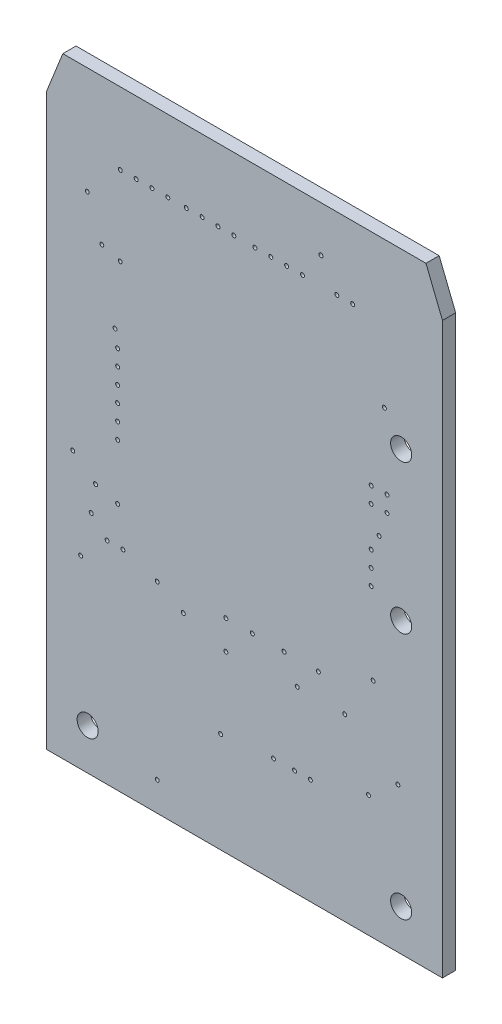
ISO-10303-21;
HEADER;
FILE_DESCRIPTION(('STEP AP214'),'2;1');
FILE_NAME('part.step','',(''),(''),'','','');
FILE_SCHEMA(('AUTOMOTIVE_DESIGN { 1 0 10303 214 1 1 1 1 }'));
ENDSEC;
DATA;
#1=APPLICATION_CONTEXT('core data for automotive mechanical design processes');
#2=APPLICATION_PROTOCOL_DEFINITION('international standard','automotive_design',2000,#1);
#3=PRODUCT_CONTEXT('',#1,'mechanical');
#4=PRODUCT('Part','Part','',(#3));
#5=PRODUCT_RELATED_PRODUCT_CATEGORY('part','',(#4));
#6=PRODUCT_DEFINITION_FORMATION('','',#4);
#7=PRODUCT_DEFINITION_CONTEXT('part definition',#1,'design');
#8=PRODUCT_DEFINITION('design','',#6,#7);
#9=PRODUCT_DEFINITION_SHAPE('','',#8);
#10=(LENGTH_UNIT() NAMED_UNIT(*) SI_UNIT(.MILLI.,.METRE.));
#11=(NAMED_UNIT(*) PLANE_ANGLE_UNIT() SI_UNIT($,.RADIAN.));
#12=(NAMED_UNIT(*) SI_UNIT($,.STERADIAN.) SOLID_ANGLE_UNIT());
#13=UNCERTAINTY_MEASURE_WITH_UNIT(LENGTH_MEASURE(1.E-05),#10,'distance_accuracy_value','');
#14=(GEOMETRIC_REPRESENTATION_CONTEXT(3) GLOBAL_UNCERTAINTY_ASSIGNED_CONTEXT((#13)) GLOBAL_UNIT_ASSIGNED_CONTEXT((#10,
#11,#12)) REPRESENTATION_CONTEXT('',''));
#15=CARTESIAN_POINT('',(0.,0.,0.));
#16=DIRECTION('',(0.,0.,1.));
#17=DIRECTION('',(1.,0.,0.));
#18=AXIS2_PLACEMENT_3D('',#15,#16,#17);
#19=CARTESIAN_POINT('',(15.24,0.,0.508));
#20=DIRECTION('',(0.,1.,0.));
#21=DIRECTION('',(0.,0.,1.));
#22=AXIS2_PLACEMENT_3D('',#19,#20,#21);
#23=PLANE('',#22);
#24=DIRECTION('',(1.,0.,0.));
#25=VECTOR('',#24,1.);
#26=CARTESIAN_POINT('',(15.24,0.,0.));
#27=LINE('',#26,#25);
#28=CARTESIAN_POINT('',(0.,0.,0.));
#29=VERTEX_POINT('',#28);
#30=CARTESIAN_POINT('',(15.24,0.,0.));
#31=VERTEX_POINT('',#30);
#32=EDGE_CURVE('E129',#29,#31,#27,.T.);
#33=ORIENTED_EDGE('',*,*,#32,.T.);
#34=DIRECTION('',(0.,0.,-1.));
#35=VECTOR('',#34,1.);
#36=CARTESIAN_POINT('',(15.24,0.,0.508));
#37=LINE('',#36,#35);
#38=CARTESIAN_POINT('',(15.24,0.,0.508));
#39=VERTEX_POINT('',#38);
#40=EDGE_CURVE('E11',#39,#31,#37,.T.);
#41=ORIENTED_EDGE('',*,*,#40,.F.);
#42=DIRECTION('',(1.,0.,0.));
#43=VECTOR('',#42,1.);
#44=CARTESIAN_POINT('',(15.24,0.,0.508));
#45=LINE('',#44,#43);
#46=CARTESIAN_POINT('',(0.,0.,0.508));
#47=VERTEX_POINT('',#46);
#48=EDGE_CURVE('E140',#47,#39,#45,.T.);
#49=ORIENTED_EDGE('',*,*,#48,.F.);
#50=DIRECTION('',(0.,0.,-1.));
#51=VECTOR('',#50,1.);
#52=CARTESIAN_POINT('',(0.,0.,0.508));
#53=LINE('',#52,#51);
#54=EDGE_CURVE('E125',#47,#29,#53,.T.);
#55=ORIENTED_EDGE('',*,*,#54,.T.);
#56=EDGE_LOOP('',(#33,#41,#49,#55));
#57=FACE_BOUND('',#56,.T.);
#58=ADVANCED_FACE('F45',(#57),#23,.F.);
#59=CARTESIAN_POINT('',(15.24,21.9075,0.508));
#60=DIRECTION('',(-1.,0.,0.));
#61=DIRECTION('',(0.,0.,1.));
#62=AXIS2_PLACEMENT_3D('',#59,#60,#61);
#63=PLANE('',#62);
#64=DIRECTION('',(0.,1.,0.));
#65=VECTOR('',#64,1.);
#66=CARTESIAN_POINT('',(15.24,21.9075,0.));
#67=LINE('',#66,#65);
#68=CARTESIAN_POINT('',(15.24,21.9075,0.));
#69=VERTEX_POINT('',#68);
#70=EDGE_CURVE('E132',#31,#69,#67,.T.);
#71=ORIENTED_EDGE('',*,*,#70,.T.);
#72=DIRECTION('',(0.,0.,-1.));
#73=VECTOR('',#72,1.);
#74=CARTESIAN_POINT('',(15.24,21.9075,0.508));
#75=LINE('',#74,#73);
#76=CARTESIAN_POINT('',(15.24,21.9075,0.508));
#77=VERTEX_POINT('',#76);
#78=EDGE_CURVE('E53',#77,#69,#75,.T.);
#79=ORIENTED_EDGE('',*,*,#78,.F.);
#80=DIRECTION('',(0.,1.,0.));
#81=VECTOR('',#80,1.);
#82=CARTESIAN_POINT('',(15.24,21.9075,0.508));
#83=LINE('',#82,#81);
#84=EDGE_CURVE('E98',#39,#77,#83,.T.);
#85=ORIENTED_EDGE('',*,*,#84,.F.);
#86=ORIENTED_EDGE('',*,*,#40,.T.);
#87=EDGE_LOOP('',(#71,#79,#85,#86));
#88=FACE_BOUND('',#87,.T.);
#89=ADVANCED_FACE('F165',(#88),#63,.F.);
#90=CARTESIAN_POINT('',(14.605,23.495,0.508));
#91=DIRECTION('',(-0.928476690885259,-0.371390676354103,0.));
#92=DIRECTION('',(0.371390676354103,-0.92847669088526,0.));
#93=AXIS2_PLACEMENT_3D('',#90,#91,#92);
#94=PLANE('',#93);
#95=DIRECTION('',(-0.371390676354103,0.928476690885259,0.));
#96=VECTOR('',#95,1.);
#97=CARTESIAN_POINT('',(14.605,23.495,0.));
#98=LINE('',#97,#96);
#99=CARTESIAN_POINT('',(14.605,23.495,0.));
#100=VERTEX_POINT('',#99);
#101=EDGE_CURVE('E135',#69,#100,#98,.T.);
#102=ORIENTED_EDGE('',*,*,#101,.T.);
#103=DIRECTION('',(0.,0.,-1.));
#104=VECTOR('',#103,1.);
#105=CARTESIAN_POINT('',(14.605,23.495,0.508));
#106=LINE('',#105,#104);
#107=CARTESIAN_POINT('',(14.605,23.495,0.508));
#108=VERTEX_POINT('',#107);
#109=EDGE_CURVE('E120',#108,#100,#106,.T.);
#110=ORIENTED_EDGE('',*,*,#109,.F.);
#111=DIRECTION('',(-0.371390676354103,0.928476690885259,0.));
#112=VECTOR('',#111,1.);
#113=CARTESIAN_POINT('',(14.605,23.495,0.508));
#114=LINE('',#113,#112);
#115=EDGE_CURVE('E111',#77,#108,#114,.T.);
#116=ORIENTED_EDGE('',*,*,#115,.F.);
#117=ORIENTED_EDGE('',*,*,#78,.T.);
#118=EDGE_LOOP('',(#102,#110,#116,#117));
#119=FACE_BOUND('',#118,.T.);
#120=ADVANCED_FACE('F146',(#119),#94,.F.);
#121=CARTESIAN_POINT('',(0.635,23.495,0.508));
#122=DIRECTION('',(0.,-1.,0.));
#123=DIRECTION('',(0.,0.,-1.));
#124=AXIS2_PLACEMENT_3D('',#121,#122,#123);
#125=PLANE('',#124);
#126=DIRECTION('',(-1.,0.,0.));
#127=VECTOR('',#126,1.);
#128=CARTESIAN_POINT('',(0.635,23.495,0.));
#129=LINE('',#128,#127);
#130=CARTESIAN_POINT('',(0.635,23.495,0.));
#131=VERTEX_POINT('',#130);
#132=EDGE_CURVE('E119',#100,#131,#129,.T.);
#133=ORIENTED_EDGE('',*,*,#132,.T.);
#134=DIRECTION('',(0.,0.,-1.));
#135=VECTOR('',#134,1.);
#136=CARTESIAN_POINT('',(0.635,23.495,0.508));
#137=LINE('',#136,#135);
#138=CARTESIAN_POINT('',(0.635,23.495,0.508));
#139=VERTEX_POINT('',#138);
#140=EDGE_CURVE('E116',#139,#131,#137,.T.);
#141=ORIENTED_EDGE('',*,*,#140,.F.);
#142=DIRECTION('',(-1.,0.,0.));
#143=VECTOR('',#142,1.);
#144=CARTESIAN_POINT('',(0.635,23.495,0.508));
#145=LINE('',#144,#143);
#146=EDGE_CURVE('E105',#108,#139,#145,.T.);
#147=ORIENTED_EDGE('',*,*,#146,.F.);
#148=ORIENTED_EDGE('',*,*,#109,.T.);
#149=EDGE_LOOP('',(#133,#141,#147,#148));
#150=FACE_BOUND('',#149,.T.);
#151=ADVANCED_FACE('F117',(#150),#125,.F.);
#152=CARTESIAN_POINT('',(0.,21.9075,0.508));
#153=DIRECTION('',(0.928476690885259,-0.371390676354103,0.));
#154=DIRECTION('',(0.371390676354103,0.92847669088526,0.));
#155=AXIS2_PLACEMENT_3D('',#152,#153,#154);
#156=PLANE('',#155);
#157=DIRECTION('',(-0.371390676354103,-0.928476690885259,0.));
#158=VECTOR('',#157,1.);
#159=CARTESIAN_POINT('',(0.,21.9075,0.));
#160=LINE('',#159,#158);
#161=CARTESIAN_POINT('',(0.,21.9075,0.));
#162=VERTEX_POINT('',#161);
#163=EDGE_CURVE('E84',#131,#162,#160,.T.);
#164=ORIENTED_EDGE('',*,*,#163,.T.);
#165=DIRECTION('',(0.,0.,-1.));
#166=VECTOR('',#165,1.);
#167=CARTESIAN_POINT('',(0.,21.9075,0.508));
#168=LINE('',#167,#166);
#169=CARTESIAN_POINT('',(0.,21.9075,0.508));
#170=VERTEX_POINT('',#169);
#171=EDGE_CURVE('E121',#170,#162,#168,.T.);
#172=ORIENTED_EDGE('',*,*,#171,.F.);
#173=DIRECTION('',(-0.371390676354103,-0.928476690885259,0.));
#174=VECTOR('',#173,1.);
#175=CARTESIAN_POINT('',(0.,21.9075,0.508));
#176=LINE('',#175,#174);
#177=EDGE_CURVE('E109',#139,#170,#176,.T.);
#178=ORIENTED_EDGE('',*,*,#177,.F.);
#179=ORIENTED_EDGE('',*,*,#140,.T.);
#180=EDGE_LOOP('',(#164,#172,#178,#179));
#181=FACE_BOUND('',#180,.T.);
#182=ADVANCED_FACE('F123',(#181),#156,.F.);
#183=CARTESIAN_POINT('',(0.,0.,0.508));
#184=DIRECTION('',(1.,0.,0.));
#185=DIRECTION('',(0.,0.,-1.));
#186=AXIS2_PLACEMENT_3D('',#183,#184,#185);
#187=PLANE('',#186);
#188=DIRECTION('',(0.,-1.,0.));
#189=VECTOR('',#188,1.);
#190=CARTESIAN_POINT('',(0.,0.,0.));
#191=LINE('',#190,#189);
#192=EDGE_CURVE('E90',#162,#29,#191,.T.);
#193=ORIENTED_EDGE('',*,*,#192,.T.);
#194=ORIENTED_EDGE('',*,*,#54,.F.);
#195=DIRECTION('',(0.,-1.,0.));
#196=VECTOR('',#195,1.);
#197=CARTESIAN_POINT('',(0.,0.,0.508));
#198=LINE('',#197,#196);
#199=EDGE_CURVE('E61',#170,#47,#198,.T.);
#200=ORIENTED_EDGE('',*,*,#199,.F.);
#201=ORIENTED_EDGE('',*,*,#171,.T.);
#202=EDGE_LOOP('',(#193,#194,#200,#201));
#203=FACE_BOUND('',#202,.T.);
#204=ADVANCED_FACE('F153',(#203),#187,.F.);
#205=CARTESIAN_POINT('',(0.,0.,0.508));
#206=DIRECTION('',(0.,0.,-1.));
#207=DIRECTION('',(-1.,0.,0.));
#208=AXIS2_PLACEMENT_3D('',#205,#206,#207);
#209=PLANE('',#208);
#210=CARTESIAN_POINT('',(1.59,1.59,0.508));
#211=DIRECTION('',(0.,0.,1.));
#212=DIRECTION('',(1.,0.,0.));
#213=AXIS2_PLACEMENT_3D('',#210,#211,#212);
#214=CIRCLE('',#213,0.405);
#215=CARTESIAN_POINT('',(1.995,1.59,0.508));
#216=VERTEX_POINT('',#215);
#217=EDGE_CURVE('E912',#216,#216,#214,.T.);
#218=ORIENTED_EDGE('',*,*,#217,.F.);
#219=EDGE_LOOP('',(#218));
#220=FACE_BOUND('',#219,.T.);
#221=CARTESIAN_POINT('',(13.65,16.83,0.508));
#222=DIRECTION('',(0.,0.,1.));
#223=DIRECTION('',(1.,0.,0.));
#224=AXIS2_PLACEMENT_3D('',#221,#222,#223);
#225=CIRCLE('',#224,0.405000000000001);
#226=CARTESIAN_POINT('',(14.055,16.83,0.508));
#227=VERTEX_POINT('',#226);
#228=EDGE_CURVE('E916',#227,#227,#225,.T.);
#229=ORIENTED_EDGE('',*,*,#228,.F.);
#230=EDGE_LOOP('',(#229));
#231=FACE_BOUND('',#230,.T.);
#232=CARTESIAN_POINT('',(13.65,11.11,0.508));
#233=DIRECTION('',(0.,0.,1.));
#234=DIRECTION('',(1.,0.,0.));
#235=AXIS2_PLACEMENT_3D('',#232,#233,#234);
#236=CIRCLE('',#235,0.405000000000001);
#237=CARTESIAN_POINT('',(14.055,11.11,0.508));
#238=VERTEX_POINT('',#237);
#239=EDGE_CURVE('E927',#238,#238,#236,.T.);
#240=ORIENTED_EDGE('',*,*,#239,.F.);
#241=EDGE_LOOP('',(#240));
#242=FACE_BOUND('',#241,.T.);
#243=CARTESIAN_POINT('',(13.65,1.59,0.508));
#244=DIRECTION('',(0.,0.,1.));
#245=DIRECTION('',(1.,0.,0.));
#246=AXIS2_PLACEMENT_3D('',#243,#244,#245);
#247=CIRCLE('',#246,0.405000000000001);
#248=CARTESIAN_POINT('',(14.055,1.59,0.508));
#249=VERTEX_POINT('',#248);
#250=EDGE_CURVE('E928',#249,#249,#247,.T.);
#251=ORIENTED_EDGE('',*,*,#250,.F.);
#252=EDGE_LOOP('',(#251));
#253=FACE_BOUND('',#252,.T.);
#254=CARTESIAN_POINT('',(11.176,20.7264,0.508));
#255=DIRECTION('',(0.,0.,1.));
#256=DIRECTION('',(1.,0.,0.));
#257=AXIS2_PLACEMENT_3D('',#254,#255,#256);
#258=CIRCLE('',#257,0.0762000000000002);
#259=CARTESIAN_POINT('',(11.2522,20.7264,0.508));
#260=VERTEX_POINT('',#259);
#261=EDGE_CURVE('E1166',#260,#260,#258,.T.);
#262=ORIENTED_EDGE('',*,*,#261,.F.);
#263=EDGE_LOOP('',(#262));
#264=FACE_BOUND('',#263,.T.);
#265=CARTESIAN_POINT('',(12.4968,15.0368,0.508));
#266=DIRECTION('',(0.,0.,1.));
#267=DIRECTION('',(1.,0.,0.));
#268=AXIS2_PLACEMENT_3D('',#265,#266,#267);
#269=CIRCLE('',#268,0.0762000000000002);
#270=CARTESIAN_POINT('',(12.573,15.0368,0.508));
#271=VERTEX_POINT('',#270);
#272=EDGE_CURVE('E1159',#271,#271,#269,.T.);
#273=ORIENTED_EDGE('',*,*,#272,.F.);
#274=EDGE_LOOP('',(#273));
#275=FACE_BOUND('',#274,.T.);
#276=CARTESIAN_POINT('',(11.7856,20.7264,0.508));
#277=DIRECTION('',(0.,0.,1.));
#278=DIRECTION('',(1.,0.,0.));
#279=AXIS2_PLACEMENT_3D('',#276,#277,#278);
#280=CIRCLE('',#279,0.0762000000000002);
#281=CARTESIAN_POINT('',(11.8618,20.7264,0.508));
#282=VERTEX_POINT('',#281);
#283=EDGE_CURVE('E1176',#282,#282,#280,.T.);
#284=ORIENTED_EDGE('',*,*,#283,.F.);
#285=EDGE_LOOP('',(#284));
#286=FACE_BOUND('',#285,.T.);
#287=CARTESIAN_POINT('',(12.4968,11.684,0.508));
#288=DIRECTION('',(0.,0.,1.));
#289=DIRECTION('',(1.,0.,0.));
#290=AXIS2_PLACEMENT_3D('',#287,#288,#289);
#291=CIRCLE('',#290,0.0762000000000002);
#292=CARTESIAN_POINT('',(12.573,11.684,0.508));
#293=VERTEX_POINT('',#292);
#294=EDGE_CURVE('E1098',#293,#293,#291,.T.);
#295=ORIENTED_EDGE('',*,*,#294,.F.);
#296=EDGE_LOOP('',(#295));
#297=FACE_BOUND('',#296,.T.);
#298=CARTESIAN_POINT('',(9.8552,20.7264,0.508));
#299=DIRECTION('',(0.,0.,1.));
#300=DIRECTION('',(1.,0.,0.));
#301=AXIS2_PLACEMENT_3D('',#298,#299,#300);
#302=CIRCLE('',#301,0.0762000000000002);
#303=CARTESIAN_POINT('',(9.9314,20.7264,0.508));
#304=VERTEX_POINT('',#303);
#305=EDGE_CURVE('E1142',#304,#304,#302,.T.);
#306=ORIENTED_EDGE('',*,*,#305,.F.);
#307=EDGE_LOOP('',(#306));
#308=FACE_BOUND('',#307,.T.);
#309=CARTESIAN_POINT('',(13.1064,14.4272,0.508));
#310=DIRECTION('',(0.,0.,1.));
#311=DIRECTION('',(1.,0.,0.));
#312=AXIS2_PLACEMENT_3D('',#309,#310,#311);
#313=CIRCLE('',#312,0.0762000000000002);
#314=CARTESIAN_POINT('',(13.1826,14.4272,0.508));
#315=VERTEX_POINT('',#314);
#316=EDGE_CURVE('E1135',#315,#315,#313,.T.);
#317=ORIENTED_EDGE('',*,*,#316,.F.);
#318=EDGE_LOOP('',(#317));
#319=FACE_BOUND('',#318,.T.);
#320=CARTESIAN_POINT('',(10.5664,21.7424,0.508));
#321=DIRECTION('',(0.,0.,1.));
#322=DIRECTION('',(1.,0.,0.));
#323=AXIS2_PLACEMENT_3D('',#320,#321,#322);
#324=CIRCLE('',#323,0.0762000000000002);
#325=CARTESIAN_POINT('',(10.6426,21.7424,0.508));
#326=VERTEX_POINT('',#325);
#327=EDGE_CURVE('E1154',#326,#326,#324,.T.);
#328=ORIENTED_EDGE('',*,*,#327,.F.);
#329=EDGE_LOOP('',(#328));
#330=FACE_BOUND('',#329,.T.);
#331=CARTESIAN_POINT('',(12.4968,14.4272,0.508));
#332=DIRECTION('',(0.,0.,1.));
#333=DIRECTION('',(1.,0.,0.));
#334=AXIS2_PLACEMENT_3D('',#331,#332,#333);
#335=CIRCLE('',#334,0.0762000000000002);
#336=CARTESIAN_POINT('',(12.573,14.4272,0.508));
#337=VERTEX_POINT('',#336);
#338=EDGE_CURVE('E1147',#337,#337,#335,.T.);
#339=ORIENTED_EDGE('',*,*,#338,.F.);
#340=EDGE_LOOP('',(#339));
#341=FACE_BOUND('',#340,.T.);
#342=CARTESIAN_POINT('',(6.604,20.7264,0.508));
#343=DIRECTION('',(0.,0.,1.));
#344=DIRECTION('',(1.,0.,0.));
#345=AXIS2_PLACEMENT_3D('',#342,#343,#344);
#346=CIRCLE('',#345,0.0762000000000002);
#347=CARTESIAN_POINT('',(6.6802,20.7264,0.508));
#348=VERTEX_POINT('',#347);
#349=EDGE_CURVE('E1118',#348,#348,#346,.T.);
#350=ORIENTED_EDGE('',*,*,#349,.F.);
#351=EDGE_LOOP('',(#350));
#352=FACE_BOUND('',#351,.T.);
#353=CARTESIAN_POINT('',(2.7432,12.9032,0.508));
#354=DIRECTION('',(0.,0.,1.));
#355=DIRECTION('',(1.,0.,0.));
#356=AXIS2_PLACEMENT_3D('',#353,#354,#355);
#357=CIRCLE('',#356,0.0761999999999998);
#358=CARTESIAN_POINT('',(2.8194,12.9032,0.508));
#359=VERTEX_POINT('',#358);
#360=EDGE_CURVE('E1111',#359,#359,#357,.T.);
#361=ORIENTED_EDGE('',*,*,#360,.F.);
#362=EDGE_LOOP('',(#361));
#363=FACE_BOUND('',#362,.T.);
#364=CARTESIAN_POINT('',(5.9944,20.7264,0.508));
#365=DIRECTION('',(0.,0.,1.));
#366=DIRECTION('',(1.,0.,0.));
#367=AXIS2_PLACEMENT_3D('',#364,#365,#366);
#368=CIRCLE('',#367,0.0762000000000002);
#369=CARTESIAN_POINT('',(6.0706,20.7264,0.508));
#370=VERTEX_POINT('',#369);
#371=EDGE_CURVE('E1130',#370,#370,#368,.T.);
#372=ORIENTED_EDGE('',*,*,#371,.F.);
#373=EDGE_LOOP('',(#372));
#374=FACE_BOUND('',#373,.T.);
#375=CARTESIAN_POINT('',(2.7432,13.5128,0.508));
#376=DIRECTION('',(0.,0.,1.));
#377=DIRECTION('',(1.,0.,0.));
#378=AXIS2_PLACEMENT_3D('',#375,#376,#377);
#379=CIRCLE('',#378,0.0761999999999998);
#380=CARTESIAN_POINT('',(2.8194,13.5128,0.508));
#381=VERTEX_POINT('',#380);
#382=EDGE_CURVE('E1123',#381,#381,#379,.T.);
#383=ORIENTED_EDGE('',*,*,#382,.F.);
#384=EDGE_LOOP('',(#383));
#385=FACE_BOUND('',#384,.T.);
#386=CARTESIAN_POINT('',(8.0264,20.7264,0.508));
#387=DIRECTION('',(0.,0.,1.));
#388=DIRECTION('',(1.,0.,0.));
#389=AXIS2_PLACEMENT_3D('',#386,#387,#388);
#390=CIRCLE('',#389,0.0762000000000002);
#391=CARTESIAN_POINT('',(8.1026,20.7264,0.508));
#392=VERTEX_POINT('',#391);
#393=EDGE_CURVE('E1092',#392,#392,#390,.T.);
#394=ORIENTED_EDGE('',*,*,#393,.F.);
#395=EDGE_LOOP('',(#394));
#396=FACE_BOUND('',#395,.T.);
#397=CARTESIAN_POINT('',(2.7432,11.684,0.508));
#398=DIRECTION('',(0.,0.,1.));
#399=DIRECTION('',(1.,0.,0.));
#400=AXIS2_PLACEMENT_3D('',#397,#398,#399);
#401=CIRCLE('',#400,0.0761999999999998);
#402=CARTESIAN_POINT('',(2.8194,11.684,0.508));
#403=VERTEX_POINT('',#402);
#404=EDGE_CURVE('E1085',#403,#403,#401,.T.);
#405=ORIENTED_EDGE('',*,*,#404,.F.);
#406=EDGE_LOOP('',(#405));
#407=FACE_BOUND('',#406,.T.);
#408=CARTESIAN_POINT('',(7.2136,20.7264,0.508));
#409=DIRECTION('',(0.,0.,1.));
#410=DIRECTION('',(1.,0.,0.));
#411=AXIS2_PLACEMENT_3D('',#408,#409,#410);
#412=CIRCLE('',#411,0.0762000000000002);
#413=CARTESIAN_POINT('',(7.2898,20.7264,0.508));
#414=VERTEX_POINT('',#413);
#415=EDGE_CURVE('E1106',#414,#414,#412,.T.);
#416=ORIENTED_EDGE('',*,*,#415,.F.);
#417=EDGE_LOOP('',(#416));
#418=FACE_BOUND('',#417,.T.);
#419=CARTESIAN_POINT('',(2.7432,12.2936,0.508));
#420=DIRECTION('',(0.,0.,1.));
#421=DIRECTION('',(1.,0.,0.));
#422=AXIS2_PLACEMENT_3D('',#419,#420,#421);
#423=CIRCLE('',#422,0.0761999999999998);
#424=CARTESIAN_POINT('',(2.8194,12.2936,0.508));
#425=VERTEX_POINT('',#424);
#426=EDGE_CURVE('E1099',#425,#425,#423,.T.);
#427=ORIENTED_EDGE('',*,*,#426,.F.);
#428=EDGE_LOOP('',(#427));
#429=FACE_BOUND('',#428,.T.);
#430=CARTESIAN_POINT('',(13.1064,15.0368,0.508));
#431=DIRECTION('',(0.,0.,1.));
#432=DIRECTION('',(1.,0.,0.));
#433=AXIS2_PLACEMENT_3D('',#430,#431,#432);
#434=CIRCLE('',#433,0.0762000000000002);
#435=CARTESIAN_POINT('',(13.1826,15.0368,0.508));
#436=VERTEX_POINT('',#435);
#437=EDGE_CURVE('E1229',#436,#436,#434,.T.);
#438=ORIENTED_EDGE('',*,*,#437,.F.);
#439=EDGE_LOOP('',(#438));
#440=FACE_BOUND('',#439,.T.);
#441=CARTESIAN_POINT('',(12.573,8.5725,0.508));
#442=DIRECTION('',(0.,0.,1.));
#443=DIRECTION('',(1.,0.,0.));
#444=AXIS2_PLACEMENT_3D('',#441,#442,#443);
#445=CIRCLE('',#444,0.0762000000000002);
#446=CARTESIAN_POINT('',(12.6492,8.5725,0.508));
#447=VERTEX_POINT('',#446);
#448=EDGE_CURVE('E1236',#447,#447,#445,.T.);
#449=ORIENTED_EDGE('',*,*,#448,.F.);
#450=EDGE_LOOP('',(#449));
#451=FACE_BOUND('',#450,.T.);
#452=CARTESIAN_POINT('',(13.5255,5.588,0.508));
#453=DIRECTION('',(0.,0.,1.));
#454=DIRECTION('',(1.,0.,0.));
#455=AXIS2_PLACEMENT_3D('',#452,#453,#454);
#456=CIRCLE('',#455,0.0762000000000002);
#457=CARTESIAN_POINT('',(13.6017,5.588,0.508));
#458=VERTEX_POINT('',#457);
#459=EDGE_CURVE('E1242',#458,#458,#456,.T.);
#460=ORIENTED_EDGE('',*,*,#459,.F.);
#461=EDGE_LOOP('',(#460));
#462=FACE_BOUND('',#461,.T.);
#463=CARTESIAN_POINT('',(5.2705,7.1755,0.508));
#464=DIRECTION('',(0.,0.,1.));
#465=DIRECTION('',(1.,0.,0.));
#466=AXIS2_PLACEMENT_3D('',#463,#464,#465);
#467=CIRCLE('',#466,0.0762000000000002);
#468=CARTESIAN_POINT('',(5.3467,7.1755,0.508));
#469=VERTEX_POINT('',#468);
#470=EDGE_CURVE('E1248',#469,#469,#467,.T.);
#471=ORIENTED_EDGE('',*,*,#470,.F.);
#472=EDGE_LOOP('',(#471));
#473=FACE_BOUND('',#472,.T.);
#474=CARTESIAN_POINT('',(1.5748,19.3675,0.508));
#475=DIRECTION('',(0.,0.,1.));
#476=DIRECTION('',(1.,0.,0.));
#477=AXIS2_PLACEMENT_3D('',#474,#475,#476);
#478=CIRCLE('',#477,0.0762);
#479=CARTESIAN_POINT('',(1.651,19.3675,0.508));
#480=VERTEX_POINT('',#479);
#481=EDGE_CURVE('E1254',#480,#480,#478,.T.);
#482=ORIENTED_EDGE('',*,*,#481,.F.);
#483=EDGE_LOOP('',(#482));
#484=FACE_BOUND('',#483,.T.);
#485=CARTESIAN_POINT('',(1.8923,9.779,0.508));
#486=DIRECTION('',(0.,0.,1.));
#487=DIRECTION('',(1.,0.,0.));
#488=AXIS2_PLACEMENT_3D('',#485,#486,#487);
#489=CIRCLE('',#488,0.0762);
#490=CARTESIAN_POINT('',(1.9685,9.779,0.508));
#491=VERTEX_POINT('',#490);
#492=EDGE_CURVE('E1260',#491,#491,#489,.T.);
#493=ORIENTED_EDGE('',*,*,#492,.F.);
#494=EDGE_LOOP('',(#493));
#495=FACE_BOUND('',#494,.T.);
#496=CARTESIAN_POINT('',(2.1336,17.8816,0.508));
#497=DIRECTION('',(0.,0.,1.));
#498=DIRECTION('',(1.,0.,0.));
#499=AXIS2_PLACEMENT_3D('',#496,#497,#498);
#500=CIRCLE('',#499,0.0761999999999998);
#501=CARTESIAN_POINT('',(2.2098,17.8816,0.508));
#502=VERTEX_POINT('',#501);
#503=EDGE_CURVE('E1266',#502,#502,#500,.T.);
#504=ORIENTED_EDGE('',*,*,#503,.F.);
#505=EDGE_LOOP('',(#504));
#506=FACE_BOUND('',#505,.T.);
#507=CARTESIAN_POINT('',(3.4544,20.7264,0.508));
#508=DIRECTION('',(0.,0.,1.));
#509=DIRECTION('',(1.,0.,0.));
#510=AXIS2_PLACEMENT_3D('',#507,#508,#509);
#511=CIRCLE('',#510,0.0761999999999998);
#512=CARTESIAN_POINT('',(3.5306,20.7264,0.508));
#513=VERTEX_POINT('',#512);
#514=EDGE_CURVE('E1272',#513,#513,#511,.T.);
#515=ORIENTED_EDGE('',*,*,#514,.F.);
#516=EDGE_LOOP('',(#515));
#517=FACE_BOUND('',#516,.T.);
#518=CARTESIAN_POINT('',(2.7432,14.732,0.508));
#519=DIRECTION('',(0.,0.,1.));
#520=DIRECTION('',(1.,0.,0.));
#521=AXIS2_PLACEMENT_3D('',#518,#519,#520);
#522=CIRCLE('',#521,0.0761999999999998);
#523=CARTESIAN_POINT('',(2.8194,14.732,0.508));
#524=VERTEX_POINT('',#523);
#525=EDGE_CURVE('E1193',#524,#524,#522,.T.);
#526=ORIENTED_EDGE('',*,*,#525,.F.);
#527=EDGE_LOOP('',(#526));
#528=FACE_BOUND('',#527,.T.);
#529=CARTESIAN_POINT('',(4.6736,20.7264,0.508));
#530=DIRECTION('',(0.,0.,1.));
#531=DIRECTION('',(1.,0.,0.));
#532=AXIS2_PLACEMENT_3D('',#529,#530,#531);
#533=CIRCLE('',#532,0.0762000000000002);
#534=CARTESIAN_POINT('',(4.7498,20.7264,0.508));
#535=VERTEX_POINT('',#534);
#536=EDGE_CURVE('E1200',#535,#535,#533,.T.);
#537=ORIENTED_EDGE('',*,*,#536,.F.);
#538=EDGE_LOOP('',(#537));
#539=FACE_BOUND('',#538,.T.);
#540=CARTESIAN_POINT('',(2.7432,14.1224,0.508));
#541=DIRECTION('',(0.,0.,1.));
#542=DIRECTION('',(1.,0.,0.));
#543=AXIS2_PLACEMENT_3D('',#540,#541,#542);
#544=CIRCLE('',#543,0.0761999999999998);
#545=CARTESIAN_POINT('',(2.8194,14.1224,0.508));
#546=VERTEX_POINT('',#545);
#547=EDGE_CURVE('E1181',#546,#546,#544,.T.);
#548=ORIENTED_EDGE('',*,*,#547,.F.);
#549=EDGE_LOOP('',(#548));
#550=FACE_BOUND('',#549,.T.);
#551=CARTESIAN_POINT('',(5.3848,20.7264,0.508));
#552=DIRECTION('',(0.,0.,1.));
#553=DIRECTION('',(1.,0.,0.));
#554=AXIS2_PLACEMENT_3D('',#551,#552,#553);
#555=CIRCLE('',#554,0.0762000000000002);
#556=CARTESIAN_POINT('',(5.461,20.7264,0.508));
#557=VERTEX_POINT('',#556);
#558=EDGE_CURVE('E1188',#557,#557,#555,.T.);
#559=ORIENTED_EDGE('',*,*,#558,.F.);
#560=EDGE_LOOP('',(#559));
#561=FACE_BOUND('',#560,.T.);
#562=CARTESIAN_POINT('',(2.6416,15.3416,0.508));
#563=DIRECTION('',(0.,0.,1.));
#564=DIRECTION('',(1.,0.,0.));
#565=AXIS2_PLACEMENT_3D('',#562,#563,#564);
#566=CIRCLE('',#565,0.0762000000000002);
#567=CARTESIAN_POINT('',(2.7178,15.3416,0.508));
#568=VERTEX_POINT('',#567);
#569=EDGE_CURVE('E1217',#568,#568,#566,.T.);
#570=ORIENTED_EDGE('',*,*,#569,.F.);
#571=EDGE_LOOP('',(#570));
#572=FACE_BOUND('',#571,.T.);
#573=CARTESIAN_POINT('',(2.8448,20.7264,0.508));
#574=DIRECTION('',(0.,0.,1.));
#575=DIRECTION('',(1.,0.,0.));
#576=AXIS2_PLACEMENT_3D('',#573,#574,#575);
#577=CIRCLE('',#576,0.0761999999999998);
#578=CARTESIAN_POINT('',(2.921,20.7264,0.508));
#579=VERTEX_POINT('',#578);
#580=EDGE_CURVE('E1224',#579,#579,#577,.T.);
#581=ORIENTED_EDGE('',*,*,#580,.F.);
#582=EDGE_LOOP('',(#581));
#583=FACE_BOUND('',#582,.T.);
#584=CARTESIAN_POINT('',(2.8448,17.6784,0.508));
#585=DIRECTION('',(0.,0.,1.));
#586=DIRECTION('',(1.,0.,0.));
#587=AXIS2_PLACEMENT_3D('',#584,#585,#586);
#588=CIRCLE('',#587,0.0761999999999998);
#589=CARTESIAN_POINT('',(2.921,17.6784,0.508));
#590=VERTEX_POINT('',#589);
#591=EDGE_CURVE('E1205',#590,#590,#588,.T.);
#592=ORIENTED_EDGE('',*,*,#591,.F.);
#593=EDGE_LOOP('',(#592));
#594=FACE_BOUND('',#593,.T.);
#595=CARTESIAN_POINT('',(4.064,20.7264,0.508));
#596=DIRECTION('',(0.,0.,1.));
#597=DIRECTION('',(1.,0.,0.));
#598=AXIS2_PLACEMENT_3D('',#595,#596,#597);
#599=CIRCLE('',#598,0.0762000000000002);
#600=CARTESIAN_POINT('',(4.1402,20.7264,0.508));
#601=VERTEX_POINT('',#600);
#602=EDGE_CURVE('E1212',#601,#601,#599,.T.);
#603=ORIENTED_EDGE('',*,*,#602,.F.);
#604=EDGE_LOOP('',(#603));
#605=FACE_BOUND('',#604,.T.);
#606=CARTESIAN_POINT('',(4.2672,1.1176,0.508));
#607=DIRECTION('',(0.,0.,1.));
#608=DIRECTION('',(1.,0.,0.));
#609=AXIS2_PLACEMENT_3D('',#606,#607,#608);
#610=CIRCLE('',#609,0.0762000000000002);
#611=CARTESIAN_POINT('',(4.3434,1.1176,0.508));
#612=VERTEX_POINT('',#611);
#613=EDGE_CURVE('E959',#612,#612,#610,.T.);
#614=ORIENTED_EDGE('',*,*,#613,.F.);
#615=EDGE_LOOP('',(#614));
#616=FACE_BOUND('',#615,.T.);
#617=CARTESIAN_POINT('',(2.3368,8.128,0.508));
#618=DIRECTION('',(0.,0.,1.));
#619=DIRECTION('',(1.,0.,0.));
#620=AXIS2_PLACEMENT_3D('',#617,#618,#619);
#621=CIRCLE('',#620,0.0761999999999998);
#622=CARTESIAN_POINT('',(2.413,8.128,0.508));
#623=VERTEX_POINT('',#622);
#624=EDGE_CURVE('E953',#623,#623,#621,.T.);
#625=ORIENTED_EDGE('',*,*,#624,.F.);
#626=EDGE_LOOP('',(#625));
#627=FACE_BOUND('',#626,.T.);
#628=CARTESIAN_POINT('',(1.7272,8.7376,0.508));
#629=DIRECTION('',(0.,0.,1.));
#630=DIRECTION('',(1.,0.,0.));
#631=AXIS2_PLACEMENT_3D('',#628,#629,#630);
#632=CIRCLE('',#631,0.0762);
#633=CARTESIAN_POINT('',(1.8034,8.7376,0.508));
#634=VERTEX_POINT('',#633);
#635=EDGE_CURVE('E947',#634,#634,#632,.T.);
#636=ORIENTED_EDGE('',*,*,#635,.F.);
#637=EDGE_LOOP('',(#636));
#638=FACE_BOUND('',#637,.T.);
#639=CARTESIAN_POINT('',(1.016,10.4648,0.508));
#640=DIRECTION('',(0.,0.,1.));
#641=DIRECTION('',(1.,0.,0.));
#642=AXIS2_PLACEMENT_3D('',#639,#640,#641);
#643=CIRCLE('',#642,0.0762);
#644=CARTESIAN_POINT('',(1.0922,10.4648,0.508));
#645=VERTEX_POINT('',#644);
#646=EDGE_CURVE('E940',#645,#645,#643,.T.);
#647=ORIENTED_EDGE('',*,*,#646,.F.);
#648=EDGE_LOOP('',(#647));
#649=FACE_BOUND('',#648,.T.);
#650=CARTESIAN_POINT('',(11.4808,6.9088,0.508));
#651=DIRECTION('',(0.,0.,1.));
#652=DIRECTION('',(1.,0.,0.));
#653=AXIS2_PLACEMENT_3D('',#650,#651,#652);
#654=CIRCLE('',#653,0.0762000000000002);
#655=CARTESIAN_POINT('',(11.557,6.9088,0.508));
#656=VERTEX_POINT('',#655);
#657=EDGE_CURVE('E976',#656,#656,#654,.T.);
#658=ORIENTED_EDGE('',*,*,#657,.F.);
#659=EDGE_LOOP('',(#658));
#660=FACE_BOUND('',#659,.T.);
#661=CARTESIAN_POINT('',(2.7432,9.5504,0.508));
#662=DIRECTION('',(0.,0.,1.));
#663=DIRECTION('',(1.,0.,0.));
#664=AXIS2_PLACEMENT_3D('',#661,#662,#663);
#665=CIRCLE('',#664,0.0761999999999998);
#666=CARTESIAN_POINT('',(2.8194,9.5504,0.508));
#667=VERTEX_POINT('',#666);
#668=EDGE_CURVE('E983',#667,#667,#665,.T.);
#669=ORIENTED_EDGE('',*,*,#668,.F.);
#670=EDGE_LOOP('',(#669));
#671=FACE_BOUND('',#670,.T.);
#672=CARTESIAN_POINT('',(1.3208,7.112,0.508));
#673=DIRECTION('',(0.,0.,1.));
#674=DIRECTION('',(1.,0.,0.));
#675=AXIS2_PLACEMENT_3D('',#672,#673,#674);
#676=CIRCLE('',#675,0.0762);
#677=CARTESIAN_POINT('',(1.397,7.112,0.508));
#678=VERTEX_POINT('',#677);
#679=EDGE_CURVE('E964',#678,#678,#676,.T.);
#680=ORIENTED_EDGE('',*,*,#679,.F.);
#681=EDGE_LOOP('',(#680));
#682=FACE_BOUND('',#681,.T.);
#683=CARTESIAN_POINT('',(2.9464,8.128,0.508));
#684=DIRECTION('',(0.,0.,1.));
#685=DIRECTION('',(1.,0.,0.));
#686=AXIS2_PLACEMENT_3D('',#683,#684,#685);
#687=CIRCLE('',#686,0.0762000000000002);
#688=CARTESIAN_POINT('',(3.0226,8.128,0.508));
#689=VERTEX_POINT('',#688);
#690=EDGE_CURVE('E971',#689,#689,#687,.T.);
#691=ORIENTED_EDGE('',*,*,#690,.F.);
#692=EDGE_LOOP('',(#691));
#693=FACE_BOUND('',#692,.T.);
#694=CARTESIAN_POINT('',(4.2672,7.7216,0.508));
#695=DIRECTION('',(0.,0.,1.));
#696=DIRECTION('',(1.,0.,0.));
#697=AXIS2_PLACEMENT_3D('',#694,#695,#696);
#698=CIRCLE('',#697,0.0762000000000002);
#699=CARTESIAN_POINT('',(4.3434,7.7216,0.508));
#700=VERTEX_POINT('',#699);
#701=EDGE_CURVE('E934',#700,#700,#698,.T.);
#702=ORIENTED_EDGE('',*,*,#701,.F.);
#703=EDGE_LOOP('',(#702));
#704=FACE_BOUND('',#703,.T.);
#705=CARTESIAN_POINT('',(8.636,20.7264,0.508));
#706=DIRECTION('',(0.,0.,1.));
#707=DIRECTION('',(1.,0.,0.));
#708=AXIS2_PLACEMENT_3D('',#705,#706,#707);
#709=CIRCLE('',#708,0.0762000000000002);
#710=CARTESIAN_POINT('',(8.7122,20.7264,0.508));
#711=VERTEX_POINT('',#710);
#712=EDGE_CURVE('E1044',#711,#711,#709,.T.);
#713=ORIENTED_EDGE('',*,*,#712,.F.);
#714=EDGE_LOOP('',(#713));
#715=FACE_BOUND('',#714,.T.);
#716=CARTESIAN_POINT('',(12.4968,12.9032,0.508));
#717=DIRECTION('',(0.,0.,1.));
#718=DIRECTION('',(1.,0.,0.));
#719=AXIS2_PLACEMENT_3D('',#716,#717,#718);
#720=CIRCLE('',#719,0.0762000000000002);
#721=CARTESIAN_POINT('',(12.573,12.9032,0.508));
#722=VERTEX_POINT('',#721);
#723=EDGE_CURVE('E1036',#722,#722,#720,.T.);
#724=ORIENTED_EDGE('',*,*,#723,.F.);
#725=EDGE_LOOP('',(#724));
#726=FACE_BOUND('',#725,.T.);
#727=CARTESIAN_POINT('',(9.2456,20.7264,0.508));
#728=DIRECTION('',(0.,0.,1.));
#729=DIRECTION('',(1.,0.,0.));
#730=AXIS2_PLACEMENT_3D('',#727,#728,#729);
#731=CIRCLE('',#730,0.0762000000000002);
#732=CARTESIAN_POINT('',(9.3218,20.7264,0.508));
#733=VERTEX_POINT('',#732);
#734=EDGE_CURVE('E1058',#733,#733,#731,.T.);
#735=ORIENTED_EDGE('',*,*,#734,.F.);
#736=EDGE_LOOP('',(#735));
#737=FACE_BOUND('',#736,.T.);
#738=CARTESIAN_POINT('',(12.8016,13.5128,0.508));
#739=DIRECTION('',(0.,0.,1.));
#740=DIRECTION('',(1.,0.,0.));
#741=AXIS2_PLACEMENT_3D('',#738,#739,#740);
#742=CIRCLE('',#741,0.0762000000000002);
#743=CARTESIAN_POINT('',(12.8778,13.5128,0.508));
#744=VERTEX_POINT('',#743);
#745=EDGE_CURVE('E1051',#744,#744,#742,.T.);
#746=ORIENTED_EDGE('',*,*,#745,.F.);
#747=EDGE_LOOP('',(#746));
#748=FACE_BOUND('',#747,.T.);
#749=CARTESIAN_POINT('',(12.4968,12.2936,0.508));
#750=DIRECTION('',(0.,0.,1.));
#751=DIRECTION('',(1.,0.,0.));
#752=AXIS2_PLACEMENT_3D('',#749,#750,#751);
#753=CIRCLE('',#752,0.0762000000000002);
#754=CARTESIAN_POINT('',(12.573,12.2936,0.508));
#755=VERTEX_POINT('',#754);
#756=EDGE_CURVE('E1050',#755,#755,#753,.T.);
#757=ORIENTED_EDGE('',*,*,#756,.F.);
#758=EDGE_LOOP('',(#757));
#759=FACE_BOUND('',#758,.T.);
#760=CARTESIAN_POINT('',(6.9088,7.8232,0.508));
#761=DIRECTION('',(0.,0.,1.));
#762=DIRECTION('',(1.,0.,0.));
#763=AXIS2_PLACEMENT_3D('',#760,#761,#762);
#764=CIRCLE('',#763,0.0762000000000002);
#765=CARTESIAN_POINT('',(6.985,7.8232,0.508));
#766=VERTEX_POINT('',#765);
#767=EDGE_CURVE('E1068',#766,#766,#764,.T.);
#768=ORIENTED_EDGE('',*,*,#767,.F.);
#769=EDGE_LOOP('',(#768));
#770=FACE_BOUND('',#769,.T.);
#771=CARTESIAN_POINT('',(8.7376,4.064,0.508));
#772=DIRECTION('',(0.,0.,1.));
#773=DIRECTION('',(1.,0.,0.));
#774=AXIS2_PLACEMENT_3D('',#771,#772,#773);
#775=CIRCLE('',#774,0.0762000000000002);
#776=CARTESIAN_POINT('',(8.8138,4.064,0.508));
#777=VERTEX_POINT('',#776);
#778=EDGE_CURVE('E1074',#777,#777,#775,.T.);
#779=ORIENTED_EDGE('',*,*,#778,.F.);
#780=EDGE_LOOP('',(#779));
#781=FACE_BOUND('',#780,.T.);
#782=CARTESIAN_POINT('',(6.7056,3.8608,0.508));
#783=DIRECTION('',(0.,0.,1.));
#784=DIRECTION('',(1.,0.,0.));
#785=AXIS2_PLACEMENT_3D('',#782,#783,#784);
#786=CIRCLE('',#785,0.0762000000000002);
#787=CARTESIAN_POINT('',(6.7818,3.8608,0.508));
#788=VERTEX_POINT('',#787);
#789=EDGE_CURVE('E1080',#788,#788,#786,.T.);
#790=ORIENTED_EDGE('',*,*,#789,.F.);
#791=EDGE_LOOP('',(#790));
#792=FACE_BOUND('',#791,.T.);
#793=CARTESIAN_POINT('',(10.4648,7.8232,0.508));
#794=DIRECTION('',(0.,0.,1.));
#795=DIRECTION('',(1.,0.,0.));
#796=AXIS2_PLACEMENT_3D('',#793,#794,#795);
#797=CIRCLE('',#796,0.0762000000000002);
#798=CARTESIAN_POINT('',(10.541,7.8232,0.508));
#799=VERTEX_POINT('',#798);
#800=EDGE_CURVE('E1007',#799,#799,#797,.T.);
#801=ORIENTED_EDGE('',*,*,#800,.F.);
#802=EDGE_LOOP('',(#801));
#803=FACE_BOUND('',#802,.T.);
#804=CARTESIAN_POINT('',(9.144,7.8232,0.508));
#805=DIRECTION('',(0.,0.,1.));
#806=DIRECTION('',(1.,0.,0.));
#807=AXIS2_PLACEMENT_3D('',#804,#805,#806);
#808=CIRCLE('',#807,0.0762000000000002);
#809=CARTESIAN_POINT('',(9.2202,7.8232,0.508));
#810=VERTEX_POINT('',#809);
#811=EDGE_CURVE('E1001',#810,#810,#808,.T.);
#812=ORIENTED_EDGE('',*,*,#811,.F.);
#813=EDGE_LOOP('',(#812));
#814=FACE_BOUND('',#813,.T.);
#815=CARTESIAN_POINT('',(10.16,4.064,0.508));
#816=DIRECTION('',(0.,0.,1.));
#817=DIRECTION('',(1.,0.,0.));
#818=AXIS2_PLACEMENT_3D('',#815,#816,#817);
#819=CIRCLE('',#818,0.0762000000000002);
#820=CARTESIAN_POINT('',(10.2362,4.064,0.508));
#821=VERTEX_POINT('',#820);
#822=EDGE_CURVE('E995',#821,#821,#819,.T.);
#823=ORIENTED_EDGE('',*,*,#822,.F.);
#824=EDGE_LOOP('',(#823));
#825=FACE_BOUND('',#824,.T.);
#826=CARTESIAN_POINT('',(9.652,6.9088,0.508));
#827=DIRECTION('',(0.,0.,1.));
#828=DIRECTION('',(1.,0.,0.));
#829=AXIS2_PLACEMENT_3D('',#826,#827,#828);
#830=CIRCLE('',#829,0.0762000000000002);
#831=CARTESIAN_POINT('',(9.7282,6.9088,0.508));
#832=VERTEX_POINT('',#831);
#833=EDGE_CURVE('E988',#832,#832,#830,.T.);
#834=ORIENTED_EDGE('',*,*,#833,.F.);
#835=EDGE_LOOP('',(#834));
#836=FACE_BOUND('',#835,.T.);
#837=CARTESIAN_POINT('',(12.3952,4.6736,0.508));
#838=DIRECTION('',(0.,0.,1.));
#839=DIRECTION('',(1.,0.,0.));
#840=AXIS2_PLACEMENT_3D('',#837,#838,#839);
#841=CIRCLE('',#840,0.0762000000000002);
#842=CARTESIAN_POINT('',(12.4714,4.6736,0.508));
#843=VERTEX_POINT('',#842);
#844=EDGE_CURVE('E1031',#843,#843,#841,.T.);
#845=ORIENTED_EDGE('',*,*,#844,.F.);
#846=EDGE_LOOP('',(#845));
#847=FACE_BOUND('',#846,.T.);
#848=CARTESIAN_POINT('',(9.5504,4.064,0.508));
#849=DIRECTION('',(0.,0.,1.));
#850=DIRECTION('',(1.,0.,0.));
#851=AXIS2_PLACEMENT_3D('',#848,#849,#850);
#852=CIRCLE('',#851,0.0762000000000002);
#853=CARTESIAN_POINT('',(9.6266,4.064,0.508));
#854=VERTEX_POINT('',#853);
#855=EDGE_CURVE('E1025',#854,#854,#852,.T.);
#856=ORIENTED_EDGE('',*,*,#855,.F.);
#857=EDGE_LOOP('',(#856));
#858=FACE_BOUND('',#857,.T.);
#859=CARTESIAN_POINT('',(7.9248,7.8232,0.508));
#860=DIRECTION('',(0.,0.,1.));
#861=DIRECTION('',(1.,0.,0.));
#862=AXIS2_PLACEMENT_3D('',#859,#860,#861);
#863=CIRCLE('',#862,0.0762000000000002);
#864=CARTESIAN_POINT('',(8.001,7.8232,0.508));
#865=VERTEX_POINT('',#864);
#866=EDGE_CURVE('E1019',#865,#865,#863,.T.);
#867=ORIENTED_EDGE('',*,*,#866,.F.);
#868=EDGE_LOOP('',(#867));
#869=FACE_BOUND('',#868,.T.);
#870=CARTESIAN_POINT('',(6.9088,6.7056,0.508));
#871=DIRECTION('',(0.,0.,1.));
#872=DIRECTION('',(1.,0.,0.));
#873=AXIS2_PLACEMENT_3D('',#870,#871,#872);
#874=CIRCLE('',#873,0.0762000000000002);
#875=CARTESIAN_POINT('',(6.985,6.7056,0.508));
#876=VERTEX_POINT('',#875);
#877=EDGE_CURVE('E1012',#876,#876,#874,.T.);
#878=ORIENTED_EDGE('',*,*,#877,.F.);
#879=EDGE_LOOP('',(#878));
#880=FACE_BOUND('',#879,.T.);
#881=CARTESIAN_POINT('',(13.0048,17.8816,0.508));
#882=DIRECTION('',(0.,0.,1.));
#883=DIRECTION('',(1.,0.,0.));
#884=AXIS2_PLACEMENT_3D('',#881,#882,#883);
#885=CIRCLE('',#884,0.0762000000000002);
#886=CARTESIAN_POINT('',(13.081,17.8816,0.508));
#887=VERTEX_POINT('',#886);
#888=EDGE_CURVE('E133',#887,#887,#885,.T.);
#889=ORIENTED_EDGE('',*,*,#888,.F.);
#890=EDGE_LOOP('',(#889));
#891=FACE_BOUND('',#890,.T.);
#892=ORIENTED_EDGE('',*,*,#48,.T.);
#893=ORIENTED_EDGE('',*,*,#84,.T.);
#894=ORIENTED_EDGE('',*,*,#115,.T.);
#895=ORIENTED_EDGE('',*,*,#146,.T.);
#896=ORIENTED_EDGE('',*,*,#177,.T.);
#897=ORIENTED_EDGE('',*,*,#199,.T.);
#898=EDGE_LOOP('',(#892,#893,#894,#895,#896,#897));
#899=FACE_BOUND('',#898,.T.);
#900=ADVANCED_FACE('F107',(#220,#231,#242,#253,#264,#275,#286,#297,#308,#319,#330,#341,#352,
#363,#374,#385,#396,#407,#418,#429,#440,#451,#462,#473,#484,#495,#506,#517,#528,#539,#550,#561,
#572,#583,#594,#605,#616,#627,#638,#649,#660,#671,#682,#693,#704,#715,#726,#737,#748,#759,#770,
#781,#792,#803,#814,#825,#836,#847,#858,#869,#880,#891,#899),#209,.F.);
#901=CARTESIAN_POINT('',(0.,0.,0.));
#902=DIRECTION('',(0.,0.,-1.));
#903=DIRECTION('',(-1.,0.,0.));
#904=AXIS2_PLACEMENT_3D('',#901,#902,#903);
#905=PLANE('',#904);
#906=CARTESIAN_POINT('',(1.59,1.59,0.));
#907=DIRECTION('',(0.,0.,1.));
#908=DIRECTION('',(1.,0.,0.));
#909=AXIS2_PLACEMENT_3D('',#906,#907,#908);
#910=CIRCLE('',#909,0.405);
#911=CARTESIAN_POINT('',(1.995,1.59,0.));
#912=VERTEX_POINT('',#911);
#913=EDGE_CURVE('E915',#912,#912,#910,.T.);
#914=ORIENTED_EDGE('',*,*,#913,.T.);
#915=EDGE_LOOP('',(#914));
#916=FACE_BOUND('',#915,.T.);
#917=CARTESIAN_POINT('',(13.65,16.83,0.));
#918=DIRECTION('',(0.,0.,1.));
#919=DIRECTION('',(1.,0.,0.));
#920=AXIS2_PLACEMENT_3D('',#917,#918,#919);
#921=CIRCLE('',#920,0.405000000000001);
#922=CARTESIAN_POINT('',(14.055,16.83,0.));
#923=VERTEX_POINT('',#922);
#924=EDGE_CURVE('E921',#923,#923,#921,.T.);
#925=ORIENTED_EDGE('',*,*,#924,.T.);
#926=EDGE_LOOP('',(#925));
#927=FACE_BOUND('',#926,.T.);
#928=CARTESIAN_POINT('',(13.65,11.11,0.));
#929=DIRECTION('',(0.,0.,1.));
#930=DIRECTION('',(1.,0.,0.));
#931=AXIS2_PLACEMENT_3D('',#928,#929,#930);
#932=CIRCLE('',#931,0.405000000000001);
#933=CARTESIAN_POINT('',(14.055,11.11,0.));
#934=VERTEX_POINT('',#933);
#935=EDGE_CURVE('E1580',#934,#934,#932,.T.);
#936=ORIENTED_EDGE('',*,*,#935,.T.);
#937=EDGE_LOOP('',(#936));
#938=FACE_BOUND('',#937,.T.);
#939=CARTESIAN_POINT('',(13.65,1.59,0.));
#940=DIRECTION('',(0.,0.,1.));
#941=DIRECTION('',(1.,0.,0.));
#942=AXIS2_PLACEMENT_3D('',#939,#940,#941);
#943=CIRCLE('',#942,0.405000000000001);
#944=CARTESIAN_POINT('',(14.055,1.59,0.));
#945=VERTEX_POINT('',#944);
#946=EDGE_CURVE('E918',#945,#945,#943,.T.);
#947=ORIENTED_EDGE('',*,*,#946,.T.);
#948=EDGE_LOOP('',(#947));
#949=FACE_BOUND('',#948,.T.);
#950=CARTESIAN_POINT('',(11.176,20.7264,0.));
#951=DIRECTION('',(0.,0.,1.));
#952=DIRECTION('',(1.,0.,0.));
#953=AXIS2_PLACEMENT_3D('',#950,#951,#952);
#954=CIRCLE('',#953,0.0762000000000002);
#955=CARTESIAN_POINT('',(11.2522,20.7264,0.));
#956=VERTEX_POINT('',#955);
#957=EDGE_CURVE('E1150',#956,#956,#954,.T.);
#958=ORIENTED_EDGE('',*,*,#957,.T.);
#959=EDGE_LOOP('',(#958));
#960=FACE_BOUND('',#959,.T.);
#961=CARTESIAN_POINT('',(12.4968,15.0368,0.));
#962=DIRECTION('',(0.,0.,1.));
#963=DIRECTION('',(1.,0.,0.));
#964=AXIS2_PLACEMENT_3D('',#961,#962,#963);
#965=CIRCLE('',#964,0.0762000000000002);
#966=CARTESIAN_POINT('',(12.573,15.0368,0.));
#967=VERTEX_POINT('',#966);
#968=EDGE_CURVE('E1163',#967,#967,#965,.T.);
#969=ORIENTED_EDGE('',*,*,#968,.T.);
#970=EDGE_LOOP('',(#969));
#971=FACE_BOUND('',#970,.T.);
#972=CARTESIAN_POINT('',(11.7856,20.7264,0.));
#973=DIRECTION('',(0.,0.,1.));
#974=DIRECTION('',(1.,0.,0.));
#975=AXIS2_PLACEMENT_3D('',#972,#973,#974);
#976=CIRCLE('',#975,0.0762000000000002);
#977=CARTESIAN_POINT('',(11.8618,20.7264,0.));
#978=VERTEX_POINT('',#977);
#979=EDGE_CURVE('E1162',#978,#978,#976,.T.);
#980=ORIENTED_EDGE('',*,*,#979,.T.);
#981=EDGE_LOOP('',(#980));
#982=FACE_BOUND('',#981,.T.);
#983=CARTESIAN_POINT('',(12.4968,11.684,0.));
#984=DIRECTION('',(0.,0.,1.));
#985=DIRECTION('',(1.,0.,0.));
#986=AXIS2_PLACEMENT_3D('',#983,#984,#985);
#987=CIRCLE('',#986,0.0762000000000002);
#988=CARTESIAN_POINT('',(12.573,11.684,0.));
#989=VERTEX_POINT('',#988);
#990=EDGE_CURVE('E1173',#989,#989,#987,.T.);
#991=ORIENTED_EDGE('',*,*,#990,.T.);
#992=EDGE_LOOP('',(#991));
#993=FACE_BOUND('',#992,.T.);
#994=CARTESIAN_POINT('',(9.8552,20.7264,0.));
#995=DIRECTION('',(0.,0.,1.));
#996=DIRECTION('',(1.,0.,0.));
#997=AXIS2_PLACEMENT_3D('',#994,#995,#996);
#998=CIRCLE('',#997,0.0762000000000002);
#999=CARTESIAN_POINT('',(9.9314,20.7264,0.));
#1000=VERTEX_POINT('',#999);
#1001=EDGE_CURVE('E1054',#1000,#1000,#998,.T.);
#1002=ORIENTED_EDGE('',*,*,#1001,.T.);
#1003=EDGE_LOOP('',(#1002));
#1004=FACE_BOUND('',#1003,.T.);
#1005=CARTESIAN_POINT('',(13.1064,14.4272,0.));
#1006=DIRECTION('',(0.,0.,1.));
#1007=DIRECTION('',(1.,0.,0.));
#1008=AXIS2_PLACEMENT_3D('',#1005,#1006,#1007);
#1009=CIRCLE('',#1008,0.0762000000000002);
#1010=CARTESIAN_POINT('',(13.1826,14.4272,0.));
#1011=VERTEX_POINT('',#1010);
#1012=EDGE_CURVE('E1139',#1011,#1011,#1009,.T.);
#1013=ORIENTED_EDGE('',*,*,#1012,.T.);
#1014=EDGE_LOOP('',(#1013));
#1015=FACE_BOUND('',#1014,.T.);
#1016=CARTESIAN_POINT('',(10.5664,21.7424,0.));
#1017=DIRECTION('',(0.,0.,1.));
#1018=DIRECTION('',(1.,0.,0.));
#1019=AXIS2_PLACEMENT_3D('',#1016,#1017,#1018);
#1020=CIRCLE('',#1019,0.0762000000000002);
#1021=CARTESIAN_POINT('',(10.6426,21.7424,0.));
#1022=VERTEX_POINT('',#1021);
#1023=EDGE_CURVE('E1138',#1022,#1022,#1020,.T.);
#1024=ORIENTED_EDGE('',*,*,#1023,.T.);
#1025=EDGE_LOOP('',(#1024));
#1026=FACE_BOUND('',#1025,.T.);
#1027=CARTESIAN_POINT('',(12.4968,14.4272,0.));
#1028=DIRECTION('',(0.,0.,1.));
#1029=DIRECTION('',(1.,0.,0.));
#1030=AXIS2_PLACEMENT_3D('',#1027,#1028,#1029);
#1031=CIRCLE('',#1030,0.0762000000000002);
#1032=CARTESIAN_POINT('',(12.573,14.4272,0.));
#1033=VERTEX_POINT('',#1032);
#1034=EDGE_CURVE('E1151',#1033,#1033,#1031,.T.);
#1035=ORIENTED_EDGE('',*,*,#1034,.T.);
#1036=EDGE_LOOP('',(#1035));
#1037=FACE_BOUND('',#1036,.T.);
#1038=CARTESIAN_POINT('',(6.604,20.7264,0.));
#1039=DIRECTION('',(0.,0.,1.));
#1040=DIRECTION('',(1.,0.,0.));
#1041=AXIS2_PLACEMENT_3D('',#1038,#1039,#1040);
#1042=CIRCLE('',#1041,0.0762000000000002);
#1043=CARTESIAN_POINT('',(6.6802,20.7264,0.));
#1044=VERTEX_POINT('',#1043);
#1045=EDGE_CURVE('E1102',#1044,#1044,#1042,.T.);
#1046=ORIENTED_EDGE('',*,*,#1045,.T.);
#1047=EDGE_LOOP('',(#1046));
#1048=FACE_BOUND('',#1047,.T.);
#1049=CARTESIAN_POINT('',(2.7432,12.9032,0.));
#1050=DIRECTION('',(0.,0.,1.));
#1051=DIRECTION('',(1.,0.,0.));
#1052=AXIS2_PLACEMENT_3D('',#1049,#1050,#1051);
#1053=CIRCLE('',#1052,0.0761999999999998);
#1054=CARTESIAN_POINT('',(2.8194,12.9032,0.));
#1055=VERTEX_POINT('',#1054);
#1056=EDGE_CURVE('E1115',#1055,#1055,#1053,.T.);
#1057=ORIENTED_EDGE('',*,*,#1056,.T.);
#1058=EDGE_LOOP('',(#1057));
#1059=FACE_BOUND('',#1058,.T.);
#1060=CARTESIAN_POINT('',(5.9944,20.7264,0.));
#1061=DIRECTION('',(0.,0.,1.));
#1062=DIRECTION('',(1.,0.,0.));
#1063=AXIS2_PLACEMENT_3D('',#1060,#1061,#1062);
#1064=CIRCLE('',#1063,0.0762000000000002);
#1065=CARTESIAN_POINT('',(6.0706,20.7264,0.));
#1066=VERTEX_POINT('',#1065);
#1067=EDGE_CURVE('E1114',#1066,#1066,#1064,.T.);
#1068=ORIENTED_EDGE('',*,*,#1067,.T.);
#1069=EDGE_LOOP('',(#1068));
#1070=FACE_BOUND('',#1069,.T.);
#1071=CARTESIAN_POINT('',(2.7432,13.5128,0.));
#1072=DIRECTION('',(0.,0.,1.));
#1073=DIRECTION('',(1.,0.,0.));
#1074=AXIS2_PLACEMENT_3D('',#1071,#1072,#1073);
#1075=CIRCLE('',#1074,0.0761999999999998);
#1076=CARTESIAN_POINT('',(2.8194,13.5128,0.));
#1077=VERTEX_POINT('',#1076);
#1078=EDGE_CURVE('E1127',#1077,#1077,#1075,.T.);
#1079=ORIENTED_EDGE('',*,*,#1078,.T.);
#1080=EDGE_LOOP('',(#1079));
#1081=FACE_BOUND('',#1080,.T.);
#1082=CARTESIAN_POINT('',(8.0264,20.7264,0.));
#1083=DIRECTION('',(0.,0.,1.));
#1084=DIRECTION('',(1.,0.,0.));
#1085=AXIS2_PLACEMENT_3D('',#1082,#1083,#1084);
#1086=CIRCLE('',#1085,0.0762000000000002);
#1087=CARTESIAN_POINT('',(8.1026,20.7264,0.));
#1088=VERTEX_POINT('',#1087);
#1089=EDGE_CURVE('E1095',#1088,#1088,#1086,.T.);
#1090=ORIENTED_EDGE('',*,*,#1089,.T.);
#1091=EDGE_LOOP('',(#1090));
#1092=FACE_BOUND('',#1091,.T.);
#1093=CARTESIAN_POINT('',(2.7432,11.684,0.));
#1094=DIRECTION('',(0.,0.,1.));
#1095=DIRECTION('',(1.,0.,0.));
#1096=AXIS2_PLACEMENT_3D('',#1093,#1094,#1095);
#1097=CIRCLE('',#1096,0.0761999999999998);
#1098=CARTESIAN_POINT('',(2.8194,11.684,0.));
#1099=VERTEX_POINT('',#1098);
#1100=EDGE_CURVE('E1089',#1099,#1099,#1097,.T.);
#1101=ORIENTED_EDGE('',*,*,#1100,.T.);
#1102=EDGE_LOOP('',(#1101));
#1103=FACE_BOUND('',#1102,.T.);
#1104=CARTESIAN_POINT('',(7.2136,20.7264,0.));
#1105=DIRECTION('',(0.,0.,1.));
#1106=DIRECTION('',(1.,0.,0.));
#1107=AXIS2_PLACEMENT_3D('',#1104,#1105,#1106);
#1108=CIRCLE('',#1107,0.0762000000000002);
#1109=CARTESIAN_POINT('',(7.2898,20.7264,0.));
#1110=VERTEX_POINT('',#1109);
#1111=EDGE_CURVE('E1088',#1110,#1110,#1108,.T.);
#1112=ORIENTED_EDGE('',*,*,#1111,.T.);
#1113=EDGE_LOOP('',(#1112));
#1114=FACE_BOUND('',#1113,.T.);
#1115=CARTESIAN_POINT('',(2.7432,12.2936,0.));
#1116=DIRECTION('',(0.,0.,1.));
#1117=DIRECTION('',(1.,0.,0.));
#1118=AXIS2_PLACEMENT_3D('',#1115,#1116,#1117);
#1119=CIRCLE('',#1118,0.0761999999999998);
#1120=CARTESIAN_POINT('',(2.8194,12.2936,0.));
#1121=VERTEX_POINT('',#1120);
#1122=EDGE_CURVE('E1103',#1121,#1121,#1119,.T.);
#1123=ORIENTED_EDGE('',*,*,#1122,.T.);
#1124=EDGE_LOOP('',(#1123));
#1125=FACE_BOUND('',#1124,.T.);
#1126=CARTESIAN_POINT('',(13.1064,15.0368,0.));
#1127=DIRECTION('',(0.,0.,1.));
#1128=DIRECTION('',(1.,0.,0.));
#1129=AXIS2_PLACEMENT_3D('',#1126,#1127,#1128);
#1130=CIRCLE('',#1129,0.0762000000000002);
#1131=CARTESIAN_POINT('',(13.1826,15.0368,0.));
#1132=VERTEX_POINT('',#1131);
#1133=EDGE_CURVE('E1233',#1132,#1132,#1130,.T.);
#1134=ORIENTED_EDGE('',*,*,#1133,.T.);
#1135=EDGE_LOOP('',(#1134));
#1136=FACE_BOUND('',#1135,.T.);
#1137=CARTESIAN_POINT('',(12.573,8.5725,0.));
#1138=DIRECTION('',(0.,0.,1.));
#1139=DIRECTION('',(1.,0.,0.));
#1140=AXIS2_PLACEMENT_3D('',#1137,#1138,#1139);
#1141=CIRCLE('',#1140,0.0762000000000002);
#1142=CARTESIAN_POINT('',(12.6492,8.5725,0.));
#1143=VERTEX_POINT('',#1142);
#1144=EDGE_CURVE('E1239',#1143,#1143,#1141,.T.);
#1145=ORIENTED_EDGE('',*,*,#1144,.T.);
#1146=EDGE_LOOP('',(#1145));
#1147=FACE_BOUND('',#1146,.T.);
#1148=CARTESIAN_POINT('',(13.5255,5.588,0.));
#1149=DIRECTION('',(0.,0.,1.));
#1150=DIRECTION('',(1.,0.,0.));
#1151=AXIS2_PLACEMENT_3D('',#1148,#1149,#1150);
#1152=CIRCLE('',#1151,0.0762000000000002);
#1153=CARTESIAN_POINT('',(13.6017,5.588,0.));
#1154=VERTEX_POINT('',#1153);
#1155=EDGE_CURVE('E1245',#1154,#1154,#1152,.T.);
#1156=ORIENTED_EDGE('',*,*,#1155,.T.);
#1157=EDGE_LOOP('',(#1156));
#1158=FACE_BOUND('',#1157,.T.);
#1159=CARTESIAN_POINT('',(5.2705,7.1755,0.));
#1160=DIRECTION('',(0.,0.,1.));
#1161=DIRECTION('',(1.,0.,0.));
#1162=AXIS2_PLACEMENT_3D('',#1159,#1160,#1161);
#1163=CIRCLE('',#1162,0.0762000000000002);
#1164=CARTESIAN_POINT('',(5.3467,7.1755,0.));
#1165=VERTEX_POINT('',#1164);
#1166=EDGE_CURVE('E1251',#1165,#1165,#1163,.T.);
#1167=ORIENTED_EDGE('',*,*,#1166,.T.);
#1168=EDGE_LOOP('',(#1167));
#1169=FACE_BOUND('',#1168,.T.);
#1170=CARTESIAN_POINT('',(1.5748,19.3675,0.));
#1171=DIRECTION('',(0.,0.,1.));
#1172=DIRECTION('',(1.,0.,0.));
#1173=AXIS2_PLACEMENT_3D('',#1170,#1171,#1172);
#1174=CIRCLE('',#1173,0.0762);
#1175=CARTESIAN_POINT('',(1.651,19.3675,0.));
#1176=VERTEX_POINT('',#1175);
#1177=EDGE_CURVE('E1257',#1176,#1176,#1174,.T.);
#1178=ORIENTED_EDGE('',*,*,#1177,.T.);
#1179=EDGE_LOOP('',(#1178));
#1180=FACE_BOUND('',#1179,.T.);
#1181=CARTESIAN_POINT('',(1.8923,9.779,0.));
#1182=DIRECTION('',(0.,0.,1.));
#1183=DIRECTION('',(1.,0.,0.));
#1184=AXIS2_PLACEMENT_3D('',#1181,#1182,#1183);
#1185=CIRCLE('',#1184,0.0762);
#1186=CARTESIAN_POINT('',(1.9685,9.779,0.));
#1187=VERTEX_POINT('',#1186);
#1188=EDGE_CURVE('E1263',#1187,#1187,#1185,.T.);
#1189=ORIENTED_EDGE('',*,*,#1188,.T.);
#1190=EDGE_LOOP('',(#1189));
#1191=FACE_BOUND('',#1190,.T.);
#1192=CARTESIAN_POINT('',(2.1336,17.8816,0.));
#1193=DIRECTION('',(0.,0.,1.));
#1194=DIRECTION('',(1.,0.,0.));
#1195=AXIS2_PLACEMENT_3D('',#1192,#1193,#1194);
#1196=CIRCLE('',#1195,0.0761999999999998);
#1197=CARTESIAN_POINT('',(2.2098,17.8816,0.));
#1198=VERTEX_POINT('',#1197);
#1199=EDGE_CURVE('E1269',#1198,#1198,#1196,.T.);
#1200=ORIENTED_EDGE('',*,*,#1199,.T.);
#1201=EDGE_LOOP('',(#1200));
#1202=FACE_BOUND('',#1201,.T.);
#1203=CARTESIAN_POINT('',(3.4544,20.7264,0.));
#1204=DIRECTION('',(0.,0.,1.));
#1205=DIRECTION('',(1.,0.,0.));
#1206=AXIS2_PLACEMENT_3D('',#1203,#1204,#1205);
#1207=CIRCLE('',#1206,0.0761999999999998);
#1208=CARTESIAN_POINT('',(3.5306,20.7264,0.));
#1209=VERTEX_POINT('',#1208);
#1210=EDGE_CURVE('E1220',#1209,#1209,#1207,.T.);
#1211=ORIENTED_EDGE('',*,*,#1210,.T.);
#1212=EDGE_LOOP('',(#1211));
#1213=FACE_BOUND('',#1212,.T.);
#1214=CARTESIAN_POINT('',(2.7432,14.732,0.));
#1215=DIRECTION('',(0.,0.,1.));
#1216=DIRECTION('',(1.,0.,0.));
#1217=AXIS2_PLACEMENT_3D('',#1214,#1215,#1216);
#1218=CIRCLE('',#1217,0.0761999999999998);
#1219=CARTESIAN_POINT('',(2.8194,14.732,0.));
#1220=VERTEX_POINT('',#1219);
#1221=EDGE_CURVE('E1197',#1220,#1220,#1218,.T.);
#1222=ORIENTED_EDGE('',*,*,#1221,.T.);
#1223=EDGE_LOOP('',(#1222));
#1224=FACE_BOUND('',#1223,.T.);
#1225=CARTESIAN_POINT('',(4.6736,20.7264,0.));
#1226=DIRECTION('',(0.,0.,1.));
#1227=DIRECTION('',(1.,0.,0.));
#1228=AXIS2_PLACEMENT_3D('',#1225,#1226,#1227);
#1229=CIRCLE('',#1228,0.0762000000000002);
#1230=CARTESIAN_POINT('',(4.7498,20.7264,0.));
#1231=VERTEX_POINT('',#1230);
#1232=EDGE_CURVE('E1184',#1231,#1231,#1229,.T.);
#1233=ORIENTED_EDGE('',*,*,#1232,.T.);
#1234=EDGE_LOOP('',(#1233));
#1235=FACE_BOUND('',#1234,.T.);
#1236=CARTESIAN_POINT('',(2.7432,14.1224,0.));
#1237=DIRECTION('',(0.,0.,1.));
#1238=DIRECTION('',(1.,0.,0.));
#1239=AXIS2_PLACEMENT_3D('',#1236,#1237,#1238);
#1240=CIRCLE('',#1239,0.0761999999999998);
#1241=CARTESIAN_POINT('',(2.8194,14.1224,0.));
#1242=VERTEX_POINT('',#1241);
#1243=EDGE_CURVE('E1185',#1242,#1242,#1240,.T.);
#1244=ORIENTED_EDGE('',*,*,#1243,.T.);
#1245=EDGE_LOOP('',(#1244));
#1246=FACE_BOUND('',#1245,.T.);
#1247=CARTESIAN_POINT('',(5.3848,20.7264,0.));
#1248=DIRECTION('',(0.,0.,1.));
#1249=DIRECTION('',(1.,0.,0.));
#1250=AXIS2_PLACEMENT_3D('',#1247,#1248,#1249);
#1251=CIRCLE('',#1250,0.0762000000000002);
#1252=CARTESIAN_POINT('',(5.461,20.7264,0.));
#1253=VERTEX_POINT('',#1252);
#1254=EDGE_CURVE('E1126',#1253,#1253,#1251,.T.);
#1255=ORIENTED_EDGE('',*,*,#1254,.T.);
#1256=EDGE_LOOP('',(#1255));
#1257=FACE_BOUND('',#1256,.T.);
#1258=CARTESIAN_POINT('',(2.6416,15.3416,0.));
#1259=DIRECTION('',(0.,0.,1.));
#1260=DIRECTION('',(1.,0.,0.));
#1261=AXIS2_PLACEMENT_3D('',#1258,#1259,#1260);
#1262=CIRCLE('',#1261,0.0762000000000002);
#1263=CARTESIAN_POINT('',(2.7178,15.3416,0.));
#1264=VERTEX_POINT('',#1263);
#1265=EDGE_CURVE('E1221',#1264,#1264,#1262,.T.);
#1266=ORIENTED_EDGE('',*,*,#1265,.T.);
#1267=EDGE_LOOP('',(#1266));
#1268=FACE_BOUND('',#1267,.T.);
#1269=CARTESIAN_POINT('',(2.8448,20.7264,0.));
#1270=DIRECTION('',(0.,0.,1.));
#1271=DIRECTION('',(1.,0.,0.));
#1272=AXIS2_PLACEMENT_3D('',#1269,#1270,#1271);
#1273=CIRCLE('',#1272,0.0761999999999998);
#1274=CARTESIAN_POINT('',(2.921,20.7264,0.));
#1275=VERTEX_POINT('',#1274);
#1276=EDGE_CURVE('E1208',#1275,#1275,#1273,.T.);
#1277=ORIENTED_EDGE('',*,*,#1276,.T.);
#1278=EDGE_LOOP('',(#1277));
#1279=FACE_BOUND('',#1278,.T.);
#1280=CARTESIAN_POINT('',(2.8448,17.6784,0.));
#1281=DIRECTION('',(0.,0.,1.));
#1282=DIRECTION('',(1.,0.,0.));
#1283=AXIS2_PLACEMENT_3D('',#1280,#1281,#1282);
#1284=CIRCLE('',#1283,0.0761999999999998);
#1285=CARTESIAN_POINT('',(2.921,17.6784,0.));
#1286=VERTEX_POINT('',#1285);
#1287=EDGE_CURVE('E1209',#1286,#1286,#1284,.T.);
#1288=ORIENTED_EDGE('',*,*,#1287,.T.);
#1289=EDGE_LOOP('',(#1288));
#1290=FACE_BOUND('',#1289,.T.);
#1291=CARTESIAN_POINT('',(4.064,20.7264,0.));
#1292=DIRECTION('',(0.,0.,1.));
#1293=DIRECTION('',(1.,0.,0.));
#1294=AXIS2_PLACEMENT_3D('',#1291,#1292,#1293);
#1295=CIRCLE('',#1294,0.0762000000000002);
#1296=CARTESIAN_POINT('',(4.1402,20.7264,0.));
#1297=VERTEX_POINT('',#1296);
#1298=EDGE_CURVE('E1196',#1297,#1297,#1295,.T.);
#1299=ORIENTED_EDGE('',*,*,#1298,.T.);
#1300=EDGE_LOOP('',(#1299));
#1301=FACE_BOUND('',#1300,.T.);
#1302=CARTESIAN_POINT('',(4.2672,1.1176,0.));
#1303=DIRECTION('',(0.,0.,1.));
#1304=DIRECTION('',(1.,0.,0.));
#1305=AXIS2_PLACEMENT_3D('',#1302,#1303,#1304);
#1306=CIRCLE('',#1305,0.0762000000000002);
#1307=CARTESIAN_POINT('',(4.3434,1.1176,0.));
#1308=VERTEX_POINT('',#1307);
#1309=EDGE_CURVE('E937',#1308,#1308,#1306,.T.);
#1310=ORIENTED_EDGE('',*,*,#1309,.T.);
#1311=EDGE_LOOP('',(#1310));
#1312=FACE_BOUND('',#1311,.T.);
#1313=CARTESIAN_POINT('',(2.3368,8.128,0.));
#1314=DIRECTION('',(0.,0.,1.));
#1315=DIRECTION('',(1.,0.,0.));
#1316=AXIS2_PLACEMENT_3D('',#1313,#1314,#1315);
#1317=CIRCLE('',#1316,0.0761999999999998);
#1318=CARTESIAN_POINT('',(2.413,8.128,0.));
#1319=VERTEX_POINT('',#1318);
#1320=EDGE_CURVE('E956',#1319,#1319,#1317,.T.);
#1321=ORIENTED_EDGE('',*,*,#1320,.T.);
#1322=EDGE_LOOP('',(#1321));
#1323=FACE_BOUND('',#1322,.T.);
#1324=CARTESIAN_POINT('',(1.7272,8.7376,0.));
#1325=DIRECTION('',(0.,0.,1.));
#1326=DIRECTION('',(1.,0.,0.));
#1327=AXIS2_PLACEMENT_3D('',#1324,#1325,#1326);
#1328=CIRCLE('',#1327,0.0762);
#1329=CARTESIAN_POINT('',(1.8034,8.7376,0.));
#1330=VERTEX_POINT('',#1329);
#1331=EDGE_CURVE('E950',#1330,#1330,#1328,.T.);
#1332=ORIENTED_EDGE('',*,*,#1331,.T.);
#1333=EDGE_LOOP('',(#1332));
#1334=FACE_BOUND('',#1333,.T.);
#1335=CARTESIAN_POINT('',(1.016,10.4648,0.));
#1336=DIRECTION('',(0.,0.,1.));
#1337=DIRECTION('',(1.,0.,0.));
#1338=AXIS2_PLACEMENT_3D('',#1335,#1336,#1337);
#1339=CIRCLE('',#1338,0.0762);
#1340=CARTESIAN_POINT('',(1.0922,10.4648,0.));
#1341=VERTEX_POINT('',#1340);
#1342=EDGE_CURVE('E944',#1341,#1341,#1339,.T.);
#1343=ORIENTED_EDGE('',*,*,#1342,.T.);
#1344=EDGE_LOOP('',(#1343));
#1345=FACE_BOUND('',#1344,.T.);
#1346=CARTESIAN_POINT('',(11.4808,6.9088,0.));
#1347=DIRECTION('',(0.,0.,1.));
#1348=DIRECTION('',(1.,0.,0.));
#1349=AXIS2_PLACEMENT_3D('',#1346,#1347,#1348);
#1350=CIRCLE('',#1349,0.0762000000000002);
#1351=CARTESIAN_POINT('',(11.557,6.9088,0.));
#1352=VERTEX_POINT('',#1351);
#1353=EDGE_CURVE('E980',#1352,#1352,#1350,.T.);
#1354=ORIENTED_EDGE('',*,*,#1353,.T.);
#1355=EDGE_LOOP('',(#1354));
#1356=FACE_BOUND('',#1355,.T.);
#1357=CARTESIAN_POINT('',(2.7432,9.5504,0.));
#1358=DIRECTION('',(0.,0.,1.));
#1359=DIRECTION('',(1.,0.,0.));
#1360=AXIS2_PLACEMENT_3D('',#1357,#1358,#1359);
#1361=CIRCLE('',#1360,0.0761999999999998);
#1362=CARTESIAN_POINT('',(2.8194,9.5504,0.));
#1363=VERTEX_POINT('',#1362);
#1364=EDGE_CURVE('E967',#1363,#1363,#1361,.T.);
#1365=ORIENTED_EDGE('',*,*,#1364,.T.);
#1366=EDGE_LOOP('',(#1365));
#1367=FACE_BOUND('',#1366,.T.);
#1368=CARTESIAN_POINT('',(1.3208,7.112,0.));
#1369=DIRECTION('',(0.,0.,1.));
#1370=DIRECTION('',(1.,0.,0.));
#1371=AXIS2_PLACEMENT_3D('',#1368,#1369,#1370);
#1372=CIRCLE('',#1371,0.0762);
#1373=CARTESIAN_POINT('',(1.397,7.112,0.));
#1374=VERTEX_POINT('',#1373);
#1375=EDGE_CURVE('E968',#1374,#1374,#1372,.T.);
#1376=ORIENTED_EDGE('',*,*,#1375,.T.);
#1377=EDGE_LOOP('',(#1376));
#1378=FACE_BOUND('',#1377,.T.);
#1379=CARTESIAN_POINT('',(2.9464,8.128,0.));
#1380=DIRECTION('',(0.,0.,1.));
#1381=DIRECTION('',(1.,0.,0.));
#1382=AXIS2_PLACEMENT_3D('',#1379,#1380,#1381);
#1383=CIRCLE('',#1382,0.0762000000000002);
#1384=CARTESIAN_POINT('',(3.0226,8.128,0.));
#1385=VERTEX_POINT('',#1384);
#1386=EDGE_CURVE('E943',#1385,#1385,#1383,.T.);
#1387=ORIENTED_EDGE('',*,*,#1386,.T.);
#1388=EDGE_LOOP('',(#1387));
#1389=FACE_BOUND('',#1388,.T.);
#1390=CARTESIAN_POINT('',(4.2672,7.7216,0.));
#1391=DIRECTION('',(0.,0.,1.));
#1392=DIRECTION('',(1.,0.,0.));
#1393=AXIS2_PLACEMENT_3D('',#1390,#1391,#1392);
#1394=CIRCLE('',#1393,0.0762000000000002);
#1395=CARTESIAN_POINT('',(4.3434,7.7216,0.));
#1396=VERTEX_POINT('',#1395);
#1397=EDGE_CURVE('E931',#1396,#1396,#1394,.T.);
#1398=ORIENTED_EDGE('',*,*,#1397,.T.);
#1399=EDGE_LOOP('',(#1398));
#1400=FACE_BOUND('',#1399,.T.);
#1401=CARTESIAN_POINT('',(8.636,20.7264,0.));
#1402=DIRECTION('',(0.,0.,1.));
#1403=DIRECTION('',(1.,0.,0.));
#1404=AXIS2_PLACEMENT_3D('',#1401,#1402,#1403);
#1405=CIRCLE('',#1404,0.0762000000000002);
#1406=CARTESIAN_POINT('',(8.7122,20.7264,0.));
#1407=VERTEX_POINT('',#1406);
#1408=EDGE_CURVE('E1047',#1407,#1407,#1405,.T.);
#1409=ORIENTED_EDGE('',*,*,#1408,.T.);
#1410=EDGE_LOOP('',(#1409));
#1411=FACE_BOUND('',#1410,.T.);
#1412=CARTESIAN_POINT('',(12.4968,12.9032,0.));
#1413=DIRECTION('',(0.,0.,1.));
#1414=DIRECTION('',(1.,0.,0.));
#1415=AXIS2_PLACEMENT_3D('',#1412,#1413,#1414);
#1416=CIRCLE('',#1415,0.0762000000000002);
#1417=CARTESIAN_POINT('',(12.573,12.9032,0.));
#1418=VERTEX_POINT('',#1417);
#1419=EDGE_CURVE('E1040',#1418,#1418,#1416,.T.);
#1420=ORIENTED_EDGE('',*,*,#1419,.T.);
#1421=EDGE_LOOP('',(#1420));
#1422=FACE_BOUND('',#1421,.T.);
#1423=CARTESIAN_POINT('',(9.2456,20.7264,0.));
#1424=DIRECTION('',(0.,0.,1.));
#1425=DIRECTION('',(1.,0.,0.));
#1426=AXIS2_PLACEMENT_3D('',#1423,#1424,#1425);
#1427=CIRCLE('',#1426,0.0762000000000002);
#1428=CARTESIAN_POINT('',(9.3218,20.7264,0.));
#1429=VERTEX_POINT('',#1428);
#1430=EDGE_CURVE('E1039',#1429,#1429,#1427,.T.);
#1431=ORIENTED_EDGE('',*,*,#1430,.T.);
#1432=EDGE_LOOP('',(#1431));
#1433=FACE_BOUND('',#1432,.T.);
#1434=CARTESIAN_POINT('',(12.8016,13.5128,0.));
#1435=DIRECTION('',(0.,0.,1.));
#1436=DIRECTION('',(1.,0.,0.));
#1437=AXIS2_PLACEMENT_3D('',#1434,#1435,#1436);
#1438=CIRCLE('',#1437,0.0762000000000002);
#1439=CARTESIAN_POINT('',(12.8778,13.5128,0.));
#1440=VERTEX_POINT('',#1439);
#1441=EDGE_CURVE('E1055',#1440,#1440,#1438,.T.);
#1442=ORIENTED_EDGE('',*,*,#1441,.T.);
#1443=EDGE_LOOP('',(#1442));
#1444=FACE_BOUND('',#1443,.T.);
#1445=CARTESIAN_POINT('',(12.4968,12.2936,0.));
#1446=DIRECTION('',(0.,0.,1.));
#1447=DIRECTION('',(1.,0.,0.));
#1448=AXIS2_PLACEMENT_3D('',#1445,#1446,#1447);
#1449=CIRCLE('',#1448,0.0762000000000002);
#1450=CARTESIAN_POINT('',(12.573,12.2936,0.));
#1451=VERTEX_POINT('',#1450);
#1452=EDGE_CURVE('E1065',#1451,#1451,#1449,.T.);
#1453=ORIENTED_EDGE('',*,*,#1452,.T.);
#1454=EDGE_LOOP('',(#1453));
#1455=FACE_BOUND('',#1454,.T.);
#1456=CARTESIAN_POINT('',(6.9088,7.8232,0.));
#1457=DIRECTION('',(0.,0.,1.));
#1458=DIRECTION('',(1.,0.,0.));
#1459=AXIS2_PLACEMENT_3D('',#1456,#1457,#1458);
#1460=CIRCLE('',#1459,0.0762000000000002);
#1461=CARTESIAN_POINT('',(6.985,7.8232,0.));
#1462=VERTEX_POINT('',#1461);
#1463=EDGE_CURVE('E1071',#1462,#1462,#1460,.T.);
#1464=ORIENTED_EDGE('',*,*,#1463,.T.);
#1465=EDGE_LOOP('',(#1464));
#1466=FACE_BOUND('',#1465,.T.);
#1467=CARTESIAN_POINT('',(8.7376,4.064,0.));
#1468=DIRECTION('',(0.,0.,1.));
#1469=DIRECTION('',(1.,0.,0.));
#1470=AXIS2_PLACEMENT_3D('',#1467,#1468,#1469);
#1471=CIRCLE('',#1470,0.0762000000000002);
#1472=CARTESIAN_POINT('',(8.8138,4.064,0.));
#1473=VERTEX_POINT('',#1472);
#1474=EDGE_CURVE('E1077',#1473,#1473,#1471,.T.);
#1475=ORIENTED_EDGE('',*,*,#1474,.T.);
#1476=EDGE_LOOP('',(#1475));
#1477=FACE_BOUND('',#1476,.T.);
#1478=CARTESIAN_POINT('',(6.7056,3.8608,0.));
#1479=DIRECTION('',(0.,0.,1.));
#1480=DIRECTION('',(1.,0.,0.));
#1481=AXIS2_PLACEMENT_3D('',#1478,#1479,#1480);
#1482=CIRCLE('',#1481,0.0762000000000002);
#1483=CARTESIAN_POINT('',(6.7818,3.8608,0.));
#1484=VERTEX_POINT('',#1483);
#1485=EDGE_CURVE('E1015',#1484,#1484,#1482,.T.);
#1486=ORIENTED_EDGE('',*,*,#1485,.T.);
#1487=EDGE_LOOP('',(#1486));
#1488=FACE_BOUND('',#1487,.T.);
#1489=CARTESIAN_POINT('',(10.4648,7.8232,0.));
#1490=DIRECTION('',(0.,0.,1.));
#1491=DIRECTION('',(1.,0.,0.));
#1492=AXIS2_PLACEMENT_3D('',#1489,#1490,#1491);
#1493=CIRCLE('',#1492,0.0762000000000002);
#1494=CARTESIAN_POINT('',(10.541,7.8232,0.));
#1495=VERTEX_POINT('',#1494);
#1496=EDGE_CURVE('E979',#1495,#1495,#1493,.T.);
#1497=ORIENTED_EDGE('',*,*,#1496,.T.);
#1498=EDGE_LOOP('',(#1497));
#1499=FACE_BOUND('',#1498,.T.);
#1500=CARTESIAN_POINT('',(9.144,7.8232,0.));
#1501=DIRECTION('',(0.,0.,1.));
#1502=DIRECTION('',(1.,0.,0.));
#1503=AXIS2_PLACEMENT_3D('',#1500,#1501,#1502);
#1504=CIRCLE('',#1503,0.0762000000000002);
#1505=CARTESIAN_POINT('',(9.2202,7.8232,0.));
#1506=VERTEX_POINT('',#1505);
#1507=EDGE_CURVE('E1004',#1506,#1506,#1504,.T.);
#1508=ORIENTED_EDGE('',*,*,#1507,.T.);
#1509=EDGE_LOOP('',(#1508));
#1510=FACE_BOUND('',#1509,.T.);
#1511=CARTESIAN_POINT('',(10.16,4.064,0.));
#1512=DIRECTION('',(0.,0.,1.));
#1513=DIRECTION('',(1.,0.,0.));
#1514=AXIS2_PLACEMENT_3D('',#1511,#1512,#1513);
#1515=CIRCLE('',#1514,0.0762000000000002);
#1516=CARTESIAN_POINT('',(10.2362,4.064,0.));
#1517=VERTEX_POINT('',#1516);
#1518=EDGE_CURVE('E998',#1517,#1517,#1515,.T.);
#1519=ORIENTED_EDGE('',*,*,#1518,.T.);
#1520=EDGE_LOOP('',(#1519));
#1521=FACE_BOUND('',#1520,.T.);
#1522=CARTESIAN_POINT('',(9.652,6.9088,0.));
#1523=DIRECTION('',(0.,0.,1.));
#1524=DIRECTION('',(1.,0.,0.));
#1525=AXIS2_PLACEMENT_3D('',#1522,#1523,#1524);
#1526=CIRCLE('',#1525,0.0762000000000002);
#1527=CARTESIAN_POINT('',(9.7282,6.9088,0.));
#1528=VERTEX_POINT('',#1527);
#1529=EDGE_CURVE('E992',#1528,#1528,#1526,.T.);
#1530=ORIENTED_EDGE('',*,*,#1529,.T.);
#1531=EDGE_LOOP('',(#1530));
#1532=FACE_BOUND('',#1531,.T.);
#1533=CARTESIAN_POINT('',(12.3952,4.6736,0.));
#1534=DIRECTION('',(0.,0.,1.));
#1535=DIRECTION('',(1.,0.,0.));
#1536=AXIS2_PLACEMENT_3D('',#1533,#1534,#1535);
#1537=CIRCLE('',#1536,0.0762000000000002);
#1538=CARTESIAN_POINT('',(12.4714,4.6736,0.));
#1539=VERTEX_POINT('',#1538);
#1540=EDGE_CURVE('E991',#1539,#1539,#1537,.T.);
#1541=ORIENTED_EDGE('',*,*,#1540,.T.);
#1542=EDGE_LOOP('',(#1541));
#1543=FACE_BOUND('',#1542,.T.);
#1544=CARTESIAN_POINT('',(9.5504,4.064,0.));
#1545=DIRECTION('',(0.,0.,1.));
#1546=DIRECTION('',(1.,0.,0.));
#1547=AXIS2_PLACEMENT_3D('',#1544,#1545,#1546);
#1548=CIRCLE('',#1547,0.0762000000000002);
#1549=CARTESIAN_POINT('',(9.6266,4.064,0.));
#1550=VERTEX_POINT('',#1549);
#1551=EDGE_CURVE('E1028',#1550,#1550,#1548,.T.);
#1552=ORIENTED_EDGE('',*,*,#1551,.T.);
#1553=EDGE_LOOP('',(#1552));
#1554=FACE_BOUND('',#1553,.T.);
#1555=CARTESIAN_POINT('',(7.9248,7.8232,0.));
#1556=DIRECTION('',(0.,0.,1.));
#1557=DIRECTION('',(1.,0.,0.));
#1558=AXIS2_PLACEMENT_3D('',#1555,#1556,#1557);
#1559=CIRCLE('',#1558,0.0762000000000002);
#1560=CARTESIAN_POINT('',(8.001,7.8232,0.));
#1561=VERTEX_POINT('',#1560);
#1562=EDGE_CURVE('E1022',#1561,#1561,#1559,.T.);
#1563=ORIENTED_EDGE('',*,*,#1562,.T.);
#1564=EDGE_LOOP('',(#1563));
#1565=FACE_BOUND('',#1564,.T.);
#1566=CARTESIAN_POINT('',(6.9088,6.7056,0.));
#1567=DIRECTION('',(0.,0.,1.));
#1568=DIRECTION('',(1.,0.,0.));
#1569=AXIS2_PLACEMENT_3D('',#1566,#1567,#1568);
#1570=CIRCLE('',#1569,0.0762000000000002);
#1571=CARTESIAN_POINT('',(6.985,6.7056,0.));
#1572=VERTEX_POINT('',#1571);
#1573=EDGE_CURVE('E1016',#1572,#1572,#1570,.T.);
#1574=ORIENTED_EDGE('',*,*,#1573,.T.);
#1575=EDGE_LOOP('',(#1574));
#1576=FACE_BOUND('',#1575,.T.);
#1577=CARTESIAN_POINT('',(13.0048,17.8816,0.));
#1578=DIRECTION('',(0.,0.,1.));
#1579=DIRECTION('',(1.,0.,0.));
#1580=AXIS2_PLACEMENT_3D('',#1577,#1578,#1579);
#1581=CIRCLE('',#1580,0.0762000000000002);
#1582=CARTESIAN_POINT('',(13.081,17.8816,0.));
#1583=VERTEX_POINT('',#1582);
#1584=EDGE_CURVE('E1232',#1583,#1583,#1581,.T.);
#1585=ORIENTED_EDGE('',*,*,#1584,.T.);
#1586=EDGE_LOOP('',(#1585));
#1587=FACE_BOUND('',#1586,.T.);
#1588=ORIENTED_EDGE('',*,*,#32,.F.);
#1589=ORIENTED_EDGE('',*,*,#192,.F.);
#1590=ORIENTED_EDGE('',*,*,#163,.F.);
#1591=ORIENTED_EDGE('',*,*,#132,.F.);
#1592=ORIENTED_EDGE('',*,*,#101,.F.);
#1593=ORIENTED_EDGE('',*,*,#70,.F.);
#1594=EDGE_LOOP('',(#1588,#1589,#1590,#1591,#1592,#1593));
#1595=FACE_BOUND('',#1594,.T.);
#1596=ADVANCED_FACE('F149',(#916,#927,#938,#949,#960,#971,#982,#993,#1004,#1015,#1026,#1037,
#1048,#1059,#1070,#1081,#1092,#1103,#1114,#1125,#1136,#1147,#1158,#1169,#1180,#1191,#1202,#1213,
#1224,#1235,#1246,#1257,#1268,#1279,#1290,#1301,#1312,#1323,#1334,#1345,#1356,#1367,#1378,#1389,
#1400,#1411,#1422,#1433,#1444,#1455,#1466,#1477,#1488,#1499,#1510,#1521,#1532,#1543,#1554,#1565,
#1576,#1587,#1595),#905,.T.);
#1597=CARTESIAN_POINT('',(13.0048,17.8816,0.508));
#1598=DIRECTION('',(0.,0.,-1.));
#1599=DIRECTION('',(-1.,0.,0.));
#1600=AXIS2_PLACEMENT_3D('',#1597,#1598,#1599);
#1601=CYLINDRICAL_SURFACE('',#1600,0.0762000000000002);
#1602=ORIENTED_EDGE('',*,*,#888,.T.);
#1603=EDGE_LOOP('',(#1602));
#1604=FACE_BOUND('',#1603,.T.);
#1605=ORIENTED_EDGE('',*,*,#1584,.F.);
#1606=EDGE_LOOP('',(#1605));
#1607=FACE_BOUND('',#1606,.T.);
#1608=ADVANCED_FACE('F398',(#1604,#1607),#1601,.F.);
#1609=CARTESIAN_POINT('',(6.9088,6.7056,0.508));
#1610=DIRECTION('',(0.,0.,-1.));
#1611=DIRECTION('',(-1.,0.,0.));
#1612=AXIS2_PLACEMENT_3D('',#1609,#1610,#1611);
#1613=CYLINDRICAL_SURFACE('',#1612,0.0762000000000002);
#1614=ORIENTED_EDGE('',*,*,#877,.T.);
#1615=EDGE_LOOP('',(#1614));
#1616=FACE_BOUND('',#1615,.T.);
#1617=ORIENTED_EDGE('',*,*,#1573,.F.);
#1618=EDGE_LOOP('',(#1617));
#1619=FACE_BOUND('',#1618,.T.);
#1620=ADVANCED_FACE('F402',(#1616,#1619),#1613,.F.);
#1621=CARTESIAN_POINT('',(7.9248,7.8232,0.508));
#1622=DIRECTION('',(0.,0.,-1.));
#1623=DIRECTION('',(-1.,0.,0.));
#1624=AXIS2_PLACEMENT_3D('',#1621,#1622,#1623);
#1625=CYLINDRICAL_SURFACE('',#1624,0.0762000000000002);
#1626=ORIENTED_EDGE('',*,*,#866,.T.);
#1627=EDGE_LOOP('',(#1626));
#1628=FACE_BOUND('',#1627,.T.);
#1629=ORIENTED_EDGE('',*,*,#1562,.F.);
#1630=EDGE_LOOP('',(#1629));
#1631=FACE_BOUND('',#1630,.T.);
#1632=ADVANCED_FACE('F620',(#1628,#1631),#1625,.F.);
#1633=CARTESIAN_POINT('',(9.5504,4.064,0.508));
#1634=DIRECTION('',(0.,0.,-1.));
#1635=DIRECTION('',(-1.,0.,0.));
#1636=AXIS2_PLACEMENT_3D('',#1633,#1634,#1635);
#1637=CYLINDRICAL_SURFACE('',#1636,0.0762000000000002);
#1638=ORIENTED_EDGE('',*,*,#855,.T.);
#1639=EDGE_LOOP('',(#1638));
#1640=FACE_BOUND('',#1639,.T.);
#1641=ORIENTED_EDGE('',*,*,#1551,.F.);
#1642=EDGE_LOOP('',(#1641));
#1643=FACE_BOUND('',#1642,.T.);
#1644=ADVANCED_FACE('F629',(#1640,#1643),#1637,.F.);
#1645=CARTESIAN_POINT('',(12.3952,4.6736,0.508));
#1646=DIRECTION('',(0.,0.,-1.));
#1647=DIRECTION('',(-1.,0.,0.));
#1648=AXIS2_PLACEMENT_3D('',#1645,#1646,#1647);
#1649=CYLINDRICAL_SURFACE('',#1648,0.0762000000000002);
#1650=ORIENTED_EDGE('',*,*,#844,.T.);
#1651=EDGE_LOOP('',(#1650));
#1652=FACE_BOUND('',#1651,.T.);
#1653=ORIENTED_EDGE('',*,*,#1540,.F.);
#1654=EDGE_LOOP('',(#1653));
#1655=FACE_BOUND('',#1654,.T.);
#1656=ADVANCED_FACE('F662',(#1652,#1655),#1649,.F.);
#1657=CARTESIAN_POINT('',(9.652,6.9088,0.508));
#1658=DIRECTION('',(0.,0.,-1.));
#1659=DIRECTION('',(-1.,0.,0.));
#1660=AXIS2_PLACEMENT_3D('',#1657,#1658,#1659);
#1661=CYLINDRICAL_SURFACE('',#1660,0.0762000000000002);
#1662=ORIENTED_EDGE('',*,*,#833,.T.);
#1663=EDGE_LOOP('',(#1662));
#1664=FACE_BOUND('',#1663,.T.);
#1665=ORIENTED_EDGE('',*,*,#1529,.F.);
#1666=EDGE_LOOP('',(#1665));
#1667=FACE_BOUND('',#1666,.T.);
#1668=ADVANCED_FACE('F658',(#1664,#1667),#1661,.F.);
#1669=CARTESIAN_POINT('',(10.16,4.064,0.508));
#1670=DIRECTION('',(0.,0.,-1.));
#1671=DIRECTION('',(-1.,0.,0.));
#1672=AXIS2_PLACEMENT_3D('',#1669,#1670,#1671);
#1673=CYLINDRICAL_SURFACE('',#1672,0.0762000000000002);
#1674=ORIENTED_EDGE('',*,*,#822,.T.);
#1675=EDGE_LOOP('',(#1674));
#1676=FACE_BOUND('',#1675,.T.);
#1677=ORIENTED_EDGE('',*,*,#1518,.F.);
#1678=EDGE_LOOP('',(#1677));
#1679=FACE_BOUND('',#1678,.T.);
#1680=ADVANCED_FACE('F651',(#1676,#1679),#1673,.F.);
#1681=CARTESIAN_POINT('',(9.144,7.8232,0.508));
#1682=DIRECTION('',(0.,0.,-1.));
#1683=DIRECTION('',(-1.,0.,0.));
#1684=AXIS2_PLACEMENT_3D('',#1681,#1682,#1683);
#1685=CYLINDRICAL_SURFACE('',#1684,0.0762000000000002);
#1686=ORIENTED_EDGE('',*,*,#811,.T.);
#1687=EDGE_LOOP('',(#1686));
#1688=FACE_BOUND('',#1687,.T.);
#1689=ORIENTED_EDGE('',*,*,#1507,.F.);
#1690=EDGE_LOOP('',(#1689));
#1691=FACE_BOUND('',#1690,.T.);
#1692=ADVANCED_FACE('F641',(#1688,#1691),#1685,.F.);
#1693=CARTESIAN_POINT('',(10.4648,7.8232,0.508));
#1694=DIRECTION('',(0.,0.,-1.));
#1695=DIRECTION('',(-1.,0.,0.));
#1696=AXIS2_PLACEMENT_3D('',#1693,#1694,#1695);
#1697=CYLINDRICAL_SURFACE('',#1696,0.0762000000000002);
#1698=ORIENTED_EDGE('',*,*,#800,.T.);
#1699=EDGE_LOOP('',(#1698));
#1700=FACE_BOUND('',#1699,.T.);
#1701=ORIENTED_EDGE('',*,*,#1496,.F.);
#1702=EDGE_LOOP('',(#1701));
#1703=FACE_BOUND('',#1702,.T.);
#1704=ADVANCED_FACE('F636',(#1700,#1703),#1697,.F.);
#1705=CARTESIAN_POINT('',(6.7056,3.8608,0.508));
#1706=DIRECTION('',(0.,0.,-1.));
#1707=DIRECTION('',(-1.,0.,0.));
#1708=AXIS2_PLACEMENT_3D('',#1705,#1706,#1707);
#1709=CYLINDRICAL_SURFACE('',#1708,0.0762000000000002);
#1710=ORIENTED_EDGE('',*,*,#789,.T.);
#1711=EDGE_LOOP('',(#1710));
#1712=FACE_BOUND('',#1711,.T.);
#1713=ORIENTED_EDGE('',*,*,#1485,.F.);
#1714=EDGE_LOOP('',(#1713));
#1715=FACE_BOUND('',#1714,.T.);
#1716=ADVANCED_FACE('F640',(#1712,#1715),#1709,.F.);
#1717=CARTESIAN_POINT('',(8.7376,4.064,0.508));
#1718=DIRECTION('',(0.,0.,-1.));
#1719=DIRECTION('',(-1.,0.,0.));
#1720=AXIS2_PLACEMENT_3D('',#1717,#1718,#1719);
#1721=CYLINDRICAL_SURFACE('',#1720,0.0762000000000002);
#1722=ORIENTED_EDGE('',*,*,#778,.T.);
#1723=EDGE_LOOP('',(#1722));
#1724=FACE_BOUND('',#1723,.T.);
#1725=ORIENTED_EDGE('',*,*,#1474,.F.);
#1726=EDGE_LOOP('',(#1725));
#1727=FACE_BOUND('',#1726,.T.);
#1728=ADVANCED_FACE('F611',(#1724,#1727),#1721,.F.);
#1729=CARTESIAN_POINT('',(6.9088,7.8232,0.508));
#1730=DIRECTION('',(0.,0.,-1.));
#1731=DIRECTION('',(-1.,0.,0.));
#1732=AXIS2_PLACEMENT_3D('',#1729,#1730,#1731);
#1733=CYLINDRICAL_SURFACE('',#1732,0.0762000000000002);
#1734=ORIENTED_EDGE('',*,*,#767,.T.);
#1735=EDGE_LOOP('',(#1734));
#1736=FACE_BOUND('',#1735,.T.);
#1737=ORIENTED_EDGE('',*,*,#1463,.F.);
#1738=EDGE_LOOP('',(#1737));
#1739=FACE_BOUND('',#1738,.T.);
#1740=ADVANCED_FACE('F445',(#1736,#1739),#1733,.F.);
#1741=CARTESIAN_POINT('',(12.4968,12.2936,0.508));
#1742=DIRECTION('',(0.,0.,-1.));
#1743=DIRECTION('',(-1.,0.,0.));
#1744=AXIS2_PLACEMENT_3D('',#1741,#1742,#1743);
#1745=CYLINDRICAL_SURFACE('',#1744,0.0762000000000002);
#1746=ORIENTED_EDGE('',*,*,#756,.T.);
#1747=EDGE_LOOP('',(#1746));
#1748=FACE_BOUND('',#1747,.T.);
#1749=ORIENTED_EDGE('',*,*,#1452,.F.);
#1750=EDGE_LOOP('',(#1749));
#1751=FACE_BOUND('',#1750,.T.);
#1752=ADVANCED_FACE('F429',(#1748,#1751),#1745,.F.);
#1753=CARTESIAN_POINT('',(12.8016,13.5128,0.508));
#1754=DIRECTION('',(0.,0.,-1.));
#1755=DIRECTION('',(-1.,0.,0.));
#1756=AXIS2_PLACEMENT_3D('',#1753,#1754,#1755);
#1757=CYLINDRICAL_SURFACE('',#1756,0.0762000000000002);
#1758=ORIENTED_EDGE('',*,*,#745,.T.);
#1759=EDGE_LOOP('',(#1758));
#1760=FACE_BOUND('',#1759,.T.);
#1761=ORIENTED_EDGE('',*,*,#1441,.F.);
#1762=EDGE_LOOP('',(#1761));
#1763=FACE_BOUND('',#1762,.T.);
#1764=ADVANCED_FACE('F313',(#1760,#1763),#1757,.F.);
#1765=CARTESIAN_POINT('',(9.2456,20.7264,0.508));
#1766=DIRECTION('',(0.,0.,-1.));
#1767=DIRECTION('',(-1.,0.,0.));
#1768=AXIS2_PLACEMENT_3D('',#1765,#1766,#1767);
#1769=CYLINDRICAL_SURFACE('',#1768,0.0762000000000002);
#1770=ORIENTED_EDGE('',*,*,#734,.T.);
#1771=EDGE_LOOP('',(#1770));
#1772=FACE_BOUND('',#1771,.T.);
#1773=ORIENTED_EDGE('',*,*,#1430,.F.);
#1774=EDGE_LOOP('',(#1773));
#1775=FACE_BOUND('',#1774,.T.);
#1776=ADVANCED_FACE('F309',(#1772,#1775),#1769,.F.);
#1777=CARTESIAN_POINT('',(12.4968,12.9032,0.508));
#1778=DIRECTION('',(0.,0.,-1.));
#1779=DIRECTION('',(-1.,0.,0.));
#1780=AXIS2_PLACEMENT_3D('',#1777,#1778,#1779);
#1781=CYLINDRICAL_SURFACE('',#1780,0.0762000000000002);
#1782=ORIENTED_EDGE('',*,*,#723,.T.);
#1783=EDGE_LOOP('',(#1782));
#1784=FACE_BOUND('',#1783,.T.);
#1785=ORIENTED_EDGE('',*,*,#1419,.F.);
#1786=EDGE_LOOP('',(#1785));
#1787=FACE_BOUND('',#1786,.T.);
#1788=ADVANCED_FACE('F251',(#1784,#1787),#1781,.F.);
#1789=CARTESIAN_POINT('',(8.636,20.7264,0.508));
#1790=DIRECTION('',(0.,0.,-1.));
#1791=DIRECTION('',(-1.,0.,0.));
#1792=AXIS2_PLACEMENT_3D('',#1789,#1790,#1791);
#1793=CYLINDRICAL_SURFACE('',#1792,0.0762000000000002);
#1794=ORIENTED_EDGE('',*,*,#712,.T.);
#1795=EDGE_LOOP('',(#1794));
#1796=FACE_BOUND('',#1795,.T.);
#1797=ORIENTED_EDGE('',*,*,#1408,.F.);
#1798=EDGE_LOOP('',(#1797));
#1799=FACE_BOUND('',#1798,.T.);
#1800=ADVANCED_FACE('F246',(#1796,#1799),#1793,.F.);
#1801=CARTESIAN_POINT('',(4.2672,7.7216,0.508));
#1802=DIRECTION('',(0.,0.,-1.));
#1803=DIRECTION('',(-1.,0.,0.));
#1804=AXIS2_PLACEMENT_3D('',#1801,#1802,#1803);
#1805=CYLINDRICAL_SURFACE('',#1804,0.0762000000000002);
#1806=ORIENTED_EDGE('',*,*,#701,.T.);
#1807=EDGE_LOOP('',(#1806));
#1808=FACE_BOUND('',#1807,.T.);
#1809=ORIENTED_EDGE('',*,*,#1397,.F.);
#1810=EDGE_LOOP('',(#1809));
#1811=FACE_BOUND('',#1810,.T.);
#1812=ADVANCED_FACE('F250',(#1808,#1811),#1805,.F.);
#1813=CARTESIAN_POINT('',(2.9464,8.128,0.508));
#1814=DIRECTION('',(0.,0.,-1.));
#1815=DIRECTION('',(-1.,0.,0.));
#1816=AXIS2_PLACEMENT_3D('',#1813,#1814,#1815);
#1817=CYLINDRICAL_SURFACE('',#1816,0.0762000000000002);
#1818=ORIENTED_EDGE('',*,*,#690,.T.);
#1819=EDGE_LOOP('',(#1818));
#1820=FACE_BOUND('',#1819,.T.);
#1821=ORIENTED_EDGE('',*,*,#1386,.F.);
#1822=EDGE_LOOP('',(#1821));
#1823=FACE_BOUND('',#1822,.T.);
#1824=ADVANCED_FACE('F534',(#1820,#1823),#1817,.F.);
#1825=CARTESIAN_POINT('',(1.3208,7.112,0.508));
#1826=DIRECTION('',(0.,0.,-1.));
#1827=DIRECTION('',(-1.,0.,0.));
#1828=AXIS2_PLACEMENT_3D('',#1825,#1826,#1827);
#1829=CYLINDRICAL_SURFACE('',#1828,0.0762);
#1830=ORIENTED_EDGE('',*,*,#679,.T.);
#1831=EDGE_LOOP('',(#1830));
#1832=FACE_BOUND('',#1831,.T.);
#1833=ORIENTED_EDGE('',*,*,#1375,.F.);
#1834=EDGE_LOOP('',(#1833));
#1835=FACE_BOUND('',#1834,.T.);
#1836=ADVANCED_FACE('F543',(#1832,#1835),#1829,.F.);
#1837=CARTESIAN_POINT('',(2.7432,9.5504,0.508));
#1838=DIRECTION('',(0.,0.,-1.));
#1839=DIRECTION('',(-1.,0.,0.));
#1840=AXIS2_PLACEMENT_3D('',#1837,#1838,#1839);
#1841=CYLINDRICAL_SURFACE('',#1840,0.0761999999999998);
#1842=ORIENTED_EDGE('',*,*,#668,.T.);
#1843=EDGE_LOOP('',(#1842));
#1844=FACE_BOUND('',#1843,.T.);
#1845=ORIENTED_EDGE('',*,*,#1364,.F.);
#1846=EDGE_LOOP('',(#1845));
#1847=FACE_BOUND('',#1846,.T.);
#1848=ADVANCED_FACE('F563',(#1844,#1847),#1841,.F.);
#1849=CARTESIAN_POINT('',(11.4808,6.9088,0.508));
#1850=DIRECTION('',(0.,0.,-1.));
#1851=DIRECTION('',(-1.,0.,0.));
#1852=AXIS2_PLACEMENT_3D('',#1849,#1850,#1851);
#1853=CYLINDRICAL_SURFACE('',#1852,0.0762000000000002);
#1854=ORIENTED_EDGE('',*,*,#657,.T.);
#1855=EDGE_LOOP('',(#1854));
#1856=FACE_BOUND('',#1855,.T.);
#1857=ORIENTED_EDGE('',*,*,#1353,.F.);
#1858=EDGE_LOOP('',(#1857));
#1859=FACE_BOUND('',#1858,.T.);
#1860=ADVANCED_FACE('F588',(#1856,#1859),#1853,.F.);
#1861=CARTESIAN_POINT('',(1.016,10.4648,0.508));
#1862=DIRECTION('',(0.,0.,-1.));
#1863=DIRECTION('',(-1.,0.,0.));
#1864=AXIS2_PLACEMENT_3D('',#1861,#1862,#1863);
#1865=CYLINDRICAL_SURFACE('',#1864,0.0762);
#1866=ORIENTED_EDGE('',*,*,#646,.T.);
#1867=EDGE_LOOP('',(#1866));
#1868=FACE_BOUND('',#1867,.T.);
#1869=ORIENTED_EDGE('',*,*,#1342,.F.);
#1870=EDGE_LOOP('',(#1869));
#1871=FACE_BOUND('',#1870,.T.);
#1872=ADVANCED_FACE('F572',(#1868,#1871),#1865,.F.);
#1873=CARTESIAN_POINT('',(1.7272,8.7376,0.508));
#1874=DIRECTION('',(0.,0.,-1.));
#1875=DIRECTION('',(-1.,0.,0.));
#1876=AXIS2_PLACEMENT_3D('',#1873,#1874,#1875);
#1877=CYLINDRICAL_SURFACE('',#1876,0.0762);
#1878=ORIENTED_EDGE('',*,*,#635,.T.);
#1879=EDGE_LOOP('',(#1878));
#1880=FACE_BOUND('',#1879,.T.);
#1881=ORIENTED_EDGE('',*,*,#1331,.F.);
#1882=EDGE_LOOP('',(#1881));
#1883=FACE_BOUND('',#1882,.T.);
#1884=ADVANCED_FACE('F554',(#1880,#1883),#1877,.F.);
#1885=CARTESIAN_POINT('',(2.3368,8.128,0.508));
#1886=DIRECTION('',(0.,0.,-1.));
#1887=DIRECTION('',(-1.,0.,0.));
#1888=AXIS2_PLACEMENT_3D('',#1885,#1886,#1887);
#1889=CYLINDRICAL_SURFACE('',#1888,0.0761999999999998);
#1890=ORIENTED_EDGE('',*,*,#624,.T.);
#1891=EDGE_LOOP('',(#1890));
#1892=FACE_BOUND('',#1891,.T.);
#1893=ORIENTED_EDGE('',*,*,#1320,.F.);
#1894=EDGE_LOOP('',(#1893));
#1895=FACE_BOUND('',#1894,.T.);
#1896=ADVANCED_FACE('F550',(#1892,#1895),#1889,.F.);
#1897=CARTESIAN_POINT('',(4.2672,1.1176,0.508));
#1898=DIRECTION('',(0.,0.,-1.));
#1899=DIRECTION('',(-1.,0.,0.));
#1900=AXIS2_PLACEMENT_3D('',#1897,#1898,#1899);
#1901=CYLINDRICAL_SURFACE('',#1900,0.0762000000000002);
#1902=ORIENTED_EDGE('',*,*,#613,.T.);
#1903=EDGE_LOOP('',(#1902));
#1904=FACE_BOUND('',#1903,.T.);
#1905=ORIENTED_EDGE('',*,*,#1309,.F.);
#1906=EDGE_LOOP('',(#1905));
#1907=FACE_BOUND('',#1906,.T.);
#1908=ADVANCED_FACE('F354',(#1904,#1907),#1901,.F.);
#1909=CARTESIAN_POINT('',(4.064,20.7264,0.508));
#1910=DIRECTION('',(0.,0.,-1.));
#1911=DIRECTION('',(-1.,0.,0.));
#1912=AXIS2_PLACEMENT_3D('',#1909,#1910,#1911);
#1913=CYLINDRICAL_SURFACE('',#1912,0.0762000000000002);
#1914=ORIENTED_EDGE('',*,*,#602,.T.);
#1915=EDGE_LOOP('',(#1914));
#1916=FACE_BOUND('',#1915,.T.);
#1917=ORIENTED_EDGE('',*,*,#1298,.F.);
#1918=EDGE_LOOP('',(#1917));
#1919=FACE_BOUND('',#1918,.T.);
#1920=ADVANCED_FACE('F349',(#1916,#1919),#1913,.F.);
#1921=CARTESIAN_POINT('',(2.8448,17.6784,0.508));
#1922=DIRECTION('',(0.,0.,-1.));
#1923=DIRECTION('',(-1.,0.,0.));
#1924=AXIS2_PLACEMENT_3D('',#1921,#1922,#1923);
#1925=CYLINDRICAL_SURFACE('',#1924,0.0761999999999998);
#1926=ORIENTED_EDGE('',*,*,#591,.T.);
#1927=EDGE_LOOP('',(#1926));
#1928=FACE_BOUND('',#1927,.T.);
#1929=ORIENTED_EDGE('',*,*,#1287,.F.);
#1930=EDGE_LOOP('',(#1929));
#1931=FACE_BOUND('',#1930,.T.);
#1932=ADVANCED_FACE('F353',(#1928,#1931),#1925,.F.);
#1933=CARTESIAN_POINT('',(2.8448,20.7264,0.508));
#1934=DIRECTION('',(0.,0.,-1.));
#1935=DIRECTION('',(-1.,0.,0.));
#1936=AXIS2_PLACEMENT_3D('',#1933,#1934,#1935);
#1937=CYLINDRICAL_SURFACE('',#1936,0.0761999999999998);
#1938=ORIENTED_EDGE('',*,*,#580,.T.);
#1939=EDGE_LOOP('',(#1938));
#1940=FACE_BOUND('',#1939,.T.);
#1941=ORIENTED_EDGE('',*,*,#1276,.F.);
#1942=EDGE_LOOP('',(#1941));
#1943=FACE_BOUND('',#1942,.T.);
#1944=ADVANCED_FACE('F362',(#1940,#1943),#1937,.F.);
#1945=CARTESIAN_POINT('',(2.6416,15.3416,0.508));
#1946=DIRECTION('',(0.,0.,-1.));
#1947=DIRECTION('',(-1.,0.,0.));
#1948=AXIS2_PLACEMENT_3D('',#1945,#1946,#1947);
#1949=CYLINDRICAL_SURFACE('',#1948,0.0762000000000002);
#1950=ORIENTED_EDGE('',*,*,#569,.T.);
#1951=EDGE_LOOP('',(#1950));
#1952=FACE_BOUND('',#1951,.T.);
#1953=ORIENTED_EDGE('',*,*,#1265,.F.);
#1954=EDGE_LOOP('',(#1953));
#1955=FACE_BOUND('',#1954,.T.);
#1956=ADVANCED_FACE('F342',(#1952,#1955),#1949,.F.);
#1957=CARTESIAN_POINT('',(5.3848,20.7264,0.508));
#1958=DIRECTION('',(0.,0.,-1.));
#1959=DIRECTION('',(-1.,0.,0.));
#1960=AXIS2_PLACEMENT_3D('',#1957,#1958,#1959);
#1961=CYLINDRICAL_SURFACE('',#1960,0.0762000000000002);
#1962=ORIENTED_EDGE('',*,*,#558,.T.);
#1963=EDGE_LOOP('',(#1962));
#1964=FACE_BOUND('',#1963,.T.);
#1965=ORIENTED_EDGE('',*,*,#1254,.F.);
#1966=EDGE_LOOP('',(#1965));
#1967=FACE_BOUND('',#1966,.T.);
#1968=ADVANCED_FACE('F338',(#1964,#1967),#1961,.F.);
#1969=CARTESIAN_POINT('',(2.7432,14.1224,0.508));
#1970=DIRECTION('',(0.,0.,-1.));
#1971=DIRECTION('',(-1.,0.,0.));
#1972=AXIS2_PLACEMENT_3D('',#1969,#1970,#1971);
#1973=CYLINDRICAL_SURFACE('',#1972,0.0761999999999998);
#1974=ORIENTED_EDGE('',*,*,#547,.T.);
#1975=EDGE_LOOP('',(#1974));
#1976=FACE_BOUND('',#1975,.T.);
#1977=ORIENTED_EDGE('',*,*,#1243,.F.);
#1978=EDGE_LOOP('',(#1977));
#1979=FACE_BOUND('',#1978,.T.);
#1980=ADVANCED_FACE('F290',(#1976,#1979),#1973,.F.);
#1981=CARTESIAN_POINT('',(4.6736,20.7264,0.508));
#1982=DIRECTION('',(0.,0.,-1.));
#1983=DIRECTION('',(-1.,0.,0.));
#1984=AXIS2_PLACEMENT_3D('',#1981,#1982,#1983);
#1985=CYLINDRICAL_SURFACE('',#1984,0.0762000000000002);
#1986=ORIENTED_EDGE('',*,*,#536,.T.);
#1987=EDGE_LOOP('',(#1986));
#1988=FACE_BOUND('',#1987,.T.);
#1989=ORIENTED_EDGE('',*,*,#1232,.F.);
#1990=EDGE_LOOP('',(#1989));
#1991=FACE_BOUND('',#1990,.T.);
#1992=ADVANCED_FACE('F285',(#1988,#1991),#1985,.F.);
#1993=CARTESIAN_POINT('',(2.7432,14.732,0.508));
#1994=DIRECTION('',(0.,0.,-1.));
#1995=DIRECTION('',(-1.,0.,0.));
#1996=AXIS2_PLACEMENT_3D('',#1993,#1994,#1995);
#1997=CYLINDRICAL_SURFACE('',#1996,0.0761999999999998);
#1998=ORIENTED_EDGE('',*,*,#525,.T.);
#1999=EDGE_LOOP('',(#1998));
#2000=FACE_BOUND('',#1999,.T.);
#2001=ORIENTED_EDGE('',*,*,#1221,.F.);
#2002=EDGE_LOOP('',(#2001));
#2003=FACE_BOUND('',#2002,.T.);
#2004=ADVANCED_FACE('F289',(#2000,#2003),#1997,.F.);
#2005=CARTESIAN_POINT('',(3.4544,20.7264,0.508));
#2006=DIRECTION('',(0.,0.,-1.));
#2007=DIRECTION('',(-1.,0.,0.));
#2008=AXIS2_PLACEMENT_3D('',#2005,#2006,#2007);
#2009=CYLINDRICAL_SURFACE('',#2008,0.0761999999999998);
#2010=ORIENTED_EDGE('',*,*,#514,.T.);
#2011=EDGE_LOOP('',(#2010));
#2012=FACE_BOUND('',#2011,.T.);
#2013=ORIENTED_EDGE('',*,*,#1210,.F.);
#2014=EDGE_LOOP('',(#2013));
#2015=FACE_BOUND('',#2014,.T.);
#2016=ADVANCED_FACE('F298',(#2012,#2015),#2009,.F.);
#2017=CARTESIAN_POINT('',(2.1336,17.8816,0.508));
#2018=DIRECTION('',(0.,0.,-1.));
#2019=DIRECTION('',(-1.,0.,0.));
#2020=AXIS2_PLACEMENT_3D('',#2017,#2018,#2019);
#2021=CYLINDRICAL_SURFACE('',#2020,0.0761999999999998);
#2022=ORIENTED_EDGE('',*,*,#503,.T.);
#2023=EDGE_LOOP('',(#2022));
#2024=FACE_BOUND('',#2023,.T.);
#2025=ORIENTED_EDGE('',*,*,#1199,.F.);
#2026=EDGE_LOOP('',(#2025));
#2027=FACE_BOUND('',#2026,.T.);
#2028=ADVANCED_FACE('F302',(#2024,#2027),#2021,.F.);
#2029=CARTESIAN_POINT('',(1.8923,9.779,0.508));
#2030=DIRECTION('',(0.,0.,-1.));
#2031=DIRECTION('',(-1.,0.,0.));
#2032=AXIS2_PLACEMENT_3D('',#2029,#2030,#2031);
#2033=CYLINDRICAL_SURFACE('',#2032,0.0762);
#2034=ORIENTED_EDGE('',*,*,#492,.T.);
#2035=EDGE_LOOP('',(#2034));
#2036=FACE_BOUND('',#2035,.T.);
#2037=ORIENTED_EDGE('',*,*,#1188,.F.);
#2038=EDGE_LOOP('',(#2037));
#2039=FACE_BOUND('',#2038,.T.);
#2040=ADVANCED_FACE('F376',(#2036,#2039),#2033,.F.);
#2041=CARTESIAN_POINT('',(1.5748,19.3675,0.508));
#2042=DIRECTION('',(0.,0.,-1.));
#2043=DIRECTION('',(-1.,0.,0.));
#2044=AXIS2_PLACEMENT_3D('',#2041,#2042,#2043);
#2045=CYLINDRICAL_SURFACE('',#2044,0.0762);
#2046=ORIENTED_EDGE('',*,*,#481,.T.);
#2047=EDGE_LOOP('',(#2046));
#2048=FACE_BOUND('',#2047,.T.);
#2049=ORIENTED_EDGE('',*,*,#1177,.F.);
#2050=EDGE_LOOP('',(#2049));
#2051=FACE_BOUND('',#2050,.T.);
#2052=ADVANCED_FACE('F371',(#2048,#2051),#2045,.F.);
#2053=CARTESIAN_POINT('',(5.2705,7.1755,0.508));
#2054=DIRECTION('',(0.,0.,-1.));
#2055=DIRECTION('',(-1.,0.,0.));
#2056=AXIS2_PLACEMENT_3D('',#2053,#2054,#2055);
#2057=CYLINDRICAL_SURFACE('',#2056,0.0762000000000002);
#2058=ORIENTED_EDGE('',*,*,#470,.T.);
#2059=EDGE_LOOP('',(#2058));
#2060=FACE_BOUND('',#2059,.T.);
#2061=ORIENTED_EDGE('',*,*,#1166,.F.);
#2062=EDGE_LOOP('',(#2061));
#2063=FACE_BOUND('',#2062,.T.);
#2064=ADVANCED_FACE('F375',(#2060,#2063),#2057,.F.);
#2065=CARTESIAN_POINT('',(13.5255,5.588,0.508));
#2066=DIRECTION('',(0.,0.,-1.));
#2067=DIRECTION('',(-1.,0.,0.));
#2068=AXIS2_PLACEMENT_3D('',#2065,#2066,#2067);
#2069=CYLINDRICAL_SURFACE('',#2068,0.0762000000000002);
#2070=ORIENTED_EDGE('',*,*,#459,.T.);
#2071=EDGE_LOOP('',(#2070));
#2072=FACE_BOUND('',#2071,.T.);
#2073=ORIENTED_EDGE('',*,*,#1155,.F.);
#2074=EDGE_LOOP('',(#2073));
#2075=FACE_BOUND('',#2074,.T.);
#2076=ADVANCED_FACE('F525',(#2072,#2075),#2069,.F.);
#2077=CARTESIAN_POINT('',(12.573,8.5725,0.508));
#2078=DIRECTION('',(0.,0.,-1.));
#2079=DIRECTION('',(-1.,0.,0.));
#2080=AXIS2_PLACEMENT_3D('',#2077,#2078,#2079);
#2081=CYLINDRICAL_SURFACE('',#2080,0.0762000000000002);
#2082=ORIENTED_EDGE('',*,*,#448,.T.);
#2083=EDGE_LOOP('',(#2082));
#2084=FACE_BOUND('',#2083,.T.);
#2085=ORIENTED_EDGE('',*,*,#1144,.F.);
#2086=EDGE_LOOP('',(#2085));
#2087=FACE_BOUND('',#2086,.T.);
#2088=ADVANCED_FACE('F413',(#2084,#2087),#2081,.F.);
#2089=CARTESIAN_POINT('',(13.1064,15.0368,0.508));
#2090=DIRECTION('',(0.,0.,-1.));
#2091=DIRECTION('',(-1.,0.,0.));
#2092=AXIS2_PLACEMENT_3D('',#2089,#2090,#2091);
#2093=CYLINDRICAL_SURFACE('',#2092,0.0762000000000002);
#2094=ORIENTED_EDGE('',*,*,#437,.T.);
#2095=EDGE_LOOP('',(#2094));
#2096=FACE_BOUND('',#2095,.T.);
#2097=ORIENTED_EDGE('',*,*,#1133,.F.);
#2098=EDGE_LOOP('',(#2097));
#2099=FACE_BOUND('',#2098,.T.);
#2100=ADVANCED_FACE('F409',(#2096,#2099),#2093,.F.);
#2101=CARTESIAN_POINT('',(2.7432,12.2936,0.508));
#2102=DIRECTION('',(0.,0.,-1.));
#2103=DIRECTION('',(-1.,0.,0.));
#2104=AXIS2_PLACEMENT_3D('',#2101,#2102,#2103);
#2105=CYLINDRICAL_SURFACE('',#2104,0.0761999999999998);
#2106=ORIENTED_EDGE('',*,*,#426,.T.);
#2107=EDGE_LOOP('',(#2106));
#2108=FACE_BOUND('',#2107,.T.);
#2109=ORIENTED_EDGE('',*,*,#1122,.F.);
#2110=EDGE_LOOP('',(#2109));
#2111=FACE_BOUND('',#2110,.T.);
#2112=ADVANCED_FACE('F264',(#2108,#2111),#2105,.F.);
#2113=CARTESIAN_POINT('',(7.2136,20.7264,0.508));
#2114=DIRECTION('',(0.,0.,-1.));
#2115=DIRECTION('',(-1.,0.,0.));
#2116=AXIS2_PLACEMENT_3D('',#2113,#2114,#2115);
#2117=CYLINDRICAL_SURFACE('',#2116,0.0762000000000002);
#2118=ORIENTED_EDGE('',*,*,#415,.T.);
#2119=EDGE_LOOP('',(#2118));
#2120=FACE_BOUND('',#2119,.T.);
#2121=ORIENTED_EDGE('',*,*,#1111,.F.);
#2122=EDGE_LOOP('',(#2121));
#2123=FACE_BOUND('',#2122,.T.);
#2124=ADVANCED_FACE('F259',(#2120,#2123),#2117,.F.);
#2125=CARTESIAN_POINT('',(2.7432,11.684,0.508));
#2126=DIRECTION('',(0.,0.,-1.));
#2127=DIRECTION('',(-1.,0.,0.));
#2128=AXIS2_PLACEMENT_3D('',#2125,#2126,#2127);
#2129=CYLINDRICAL_SURFACE('',#2128,0.0761999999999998);
#2130=ORIENTED_EDGE('',*,*,#404,.T.);
#2131=EDGE_LOOP('',(#2130));
#2132=FACE_BOUND('',#2131,.T.);
#2133=ORIENTED_EDGE('',*,*,#1100,.F.);
#2134=EDGE_LOOP('',(#2133));
#2135=FACE_BOUND('',#2134,.T.);
#2136=ADVANCED_FACE('F263',(#2132,#2135),#2129,.F.);
#2137=CARTESIAN_POINT('',(8.0264,20.7264,0.508));
#2138=DIRECTION('',(0.,0.,-1.));
#2139=DIRECTION('',(-1.,0.,0.));
#2140=AXIS2_PLACEMENT_3D('',#2137,#2138,#2139);
#2141=CYLINDRICAL_SURFACE('',#2140,0.0762000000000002);
#2142=ORIENTED_EDGE('',*,*,#393,.T.);
#2143=EDGE_LOOP('',(#2142));
#2144=FACE_BOUND('',#2143,.T.);
#2145=ORIENTED_EDGE('',*,*,#1089,.F.);
#2146=EDGE_LOOP('',(#2145));
#2147=FACE_BOUND('',#2146,.T.);
#2148=ADVANCED_FACE('F320',(#2144,#2147),#2141,.F.);
#2149=CARTESIAN_POINT('',(2.7432,13.5128,0.508));
#2150=DIRECTION('',(0.,0.,-1.));
#2151=DIRECTION('',(-1.,0.,0.));
#2152=AXIS2_PLACEMENT_3D('',#2149,#2150,#2151);
#2153=CYLINDRICAL_SURFACE('',#2152,0.0761999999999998);
#2154=ORIENTED_EDGE('',*,*,#382,.T.);
#2155=EDGE_LOOP('',(#2154));
#2156=FACE_BOUND('',#2155,.T.);
#2157=ORIENTED_EDGE('',*,*,#1078,.F.);
#2158=EDGE_LOOP('',(#2157));
#2159=FACE_BOUND('',#2158,.T.);
#2160=ADVANCED_FACE('F277',(#2156,#2159),#2153,.F.);
#2161=CARTESIAN_POINT('',(5.9944,20.7264,0.508));
#2162=DIRECTION('',(0.,0.,-1.));
#2163=DIRECTION('',(-1.,0.,0.));
#2164=AXIS2_PLACEMENT_3D('',#2161,#2162,#2163);
#2165=CYLINDRICAL_SURFACE('',#2164,0.0762000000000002);
#2166=ORIENTED_EDGE('',*,*,#371,.T.);
#2167=EDGE_LOOP('',(#2166));
#2168=FACE_BOUND('',#2167,.T.);
#2169=ORIENTED_EDGE('',*,*,#1067,.F.);
#2170=EDGE_LOOP('',(#2169));
#2171=FACE_BOUND('',#2170,.T.);
#2172=ADVANCED_FACE('F272',(#2168,#2171),#2165,.F.);
#2173=CARTESIAN_POINT('',(2.7432,12.9032,0.508));
#2174=DIRECTION('',(0.,0.,-1.));
#2175=DIRECTION('',(-1.,0.,0.));
#2176=AXIS2_PLACEMENT_3D('',#2173,#2174,#2175);
#2177=CYLINDRICAL_SURFACE('',#2176,0.0761999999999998);
#2178=ORIENTED_EDGE('',*,*,#360,.T.);
#2179=EDGE_LOOP('',(#2178));
#2180=FACE_BOUND('',#2179,.T.);
#2181=ORIENTED_EDGE('',*,*,#1056,.F.);
#2182=EDGE_LOOP('',(#2181));
#2183=FACE_BOUND('',#2182,.T.);
#2184=ADVANCED_FACE('F276',(#2180,#2183),#2177,.F.);
#2185=CARTESIAN_POINT('',(6.604,20.7264,0.508));
#2186=DIRECTION('',(0.,0.,-1.));
#2187=DIRECTION('',(-1.,0.,0.));
#2188=AXIS2_PLACEMENT_3D('',#2185,#2186,#2187);
#2189=CYLINDRICAL_SURFACE('',#2188,0.0762000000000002);
#2190=ORIENTED_EDGE('',*,*,#349,.T.);
#2191=EDGE_LOOP('',(#2190));
#2192=FACE_BOUND('',#2191,.T.);
#2193=ORIENTED_EDGE('',*,*,#1045,.F.);
#2194=EDGE_LOOP('',(#2193));
#2195=FACE_BOUND('',#2194,.T.);
#2196=ADVANCED_FACE('F329',(#2192,#2195),#2189,.F.);
#2197=CARTESIAN_POINT('',(12.4968,14.4272,0.508));
#2198=DIRECTION('',(0.,0.,-1.));
#2199=DIRECTION('',(-1.,0.,0.));
#2200=AXIS2_PLACEMENT_3D('',#2197,#2198,#2199);
#2201=CYLINDRICAL_SURFACE('',#2200,0.0762000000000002);
#2202=ORIENTED_EDGE('',*,*,#338,.T.);
#2203=EDGE_LOOP('',(#2202));
#2204=FACE_BOUND('',#2203,.T.);
#2205=ORIENTED_EDGE('',*,*,#1034,.F.);
#2206=EDGE_LOOP('',(#2205));
#2207=FACE_BOUND('',#2206,.T.);
#2208=ADVANCED_FACE('F205',(#2204,#2207),#2201,.F.);
#2209=CARTESIAN_POINT('',(10.5664,21.7424,0.508));
#2210=DIRECTION('',(0.,0.,-1.));
#2211=DIRECTION('',(-1.,0.,0.));
#2212=AXIS2_PLACEMENT_3D('',#2209,#2210,#2211);
#2213=CYLINDRICAL_SURFACE('',#2212,0.0762000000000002);
#2214=ORIENTED_EDGE('',*,*,#327,.T.);
#2215=EDGE_LOOP('',(#2214));
#2216=FACE_BOUND('',#2215,.T.);
#2217=ORIENTED_EDGE('',*,*,#1023,.F.);
#2218=EDGE_LOOP('',(#2217));
#2219=FACE_BOUND('',#2218,.T.);
#2220=ADVANCED_FACE('F200',(#2216,#2219),#2213,.F.);
#2221=CARTESIAN_POINT('',(13.1064,14.4272,0.508));
#2222=DIRECTION('',(0.,0.,-1.));
#2223=DIRECTION('',(-1.,0.,0.));
#2224=AXIS2_PLACEMENT_3D('',#2221,#2222,#2223);
#2225=CYLINDRICAL_SURFACE('',#2224,0.0762000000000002);
#2226=ORIENTED_EDGE('',*,*,#316,.T.);
#2227=EDGE_LOOP('',(#2226));
#2228=FACE_BOUND('',#2227,.T.);
#2229=ORIENTED_EDGE('',*,*,#1012,.F.);
#2230=EDGE_LOOP('',(#2229));
#2231=FACE_BOUND('',#2230,.T.);
#2232=ADVANCED_FACE('F204',(#2228,#2231),#2225,.F.);
#2233=CARTESIAN_POINT('',(9.8552,20.7264,0.508));
#2234=DIRECTION('',(0.,0.,-1.));
#2235=DIRECTION('',(-1.,0.,0.));
#2236=AXIS2_PLACEMENT_3D('',#2233,#2234,#2235);
#2237=CYLINDRICAL_SURFACE('',#2236,0.0762000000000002);
#2238=ORIENTED_EDGE('',*,*,#305,.T.);
#2239=EDGE_LOOP('',(#2238));
#2240=FACE_BOUND('',#2239,.T.);
#2241=ORIENTED_EDGE('',*,*,#1001,.F.);
#2242=EDGE_LOOP('',(#2241));
#2243=FACE_BOUND('',#2242,.T.);
#2244=ADVANCED_FACE('F237',(#2240,#2243),#2237,.F.);
#2245=CARTESIAN_POINT('',(12.4968,11.684,0.508));
#2246=DIRECTION('',(0.,0.,-1.));
#2247=DIRECTION('',(-1.,0.,0.));
#2248=AXIS2_PLACEMENT_3D('',#2245,#2246,#2247);
#2249=CYLINDRICAL_SURFACE('',#2248,0.0762000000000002);
#2250=ORIENTED_EDGE('',*,*,#294,.T.);
#2251=EDGE_LOOP('',(#2250));
#2252=FACE_BOUND('',#2251,.T.);
#2253=ORIENTED_EDGE('',*,*,#990,.F.);
#2254=EDGE_LOOP('',(#2253));
#2255=FACE_BOUND('',#2254,.T.);
#2256=ADVANCED_FACE('F218',(#2252,#2255),#2249,.F.);
#2257=CARTESIAN_POINT('',(11.7856,20.7264,0.508));
#2258=DIRECTION('',(0.,0.,-1.));
#2259=DIRECTION('',(-1.,0.,0.));
#2260=AXIS2_PLACEMENT_3D('',#2257,#2258,#2259);
#2261=CYLINDRICAL_SURFACE('',#2260,0.0762000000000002);
#2262=ORIENTED_EDGE('',*,*,#283,.T.);
#2263=EDGE_LOOP('',(#2262));
#2264=FACE_BOUND('',#2263,.T.);
#2265=ORIENTED_EDGE('',*,*,#979,.F.);
#2266=EDGE_LOOP('',(#2265));
#2267=FACE_BOUND('',#2266,.T.);
#2268=ADVANCED_FACE('F213',(#2264,#2267),#2261,.F.);
#2269=CARTESIAN_POINT('',(12.4968,15.0368,0.508));
#2270=DIRECTION('',(0.,0.,-1.));
#2271=DIRECTION('',(-1.,0.,0.));
#2272=AXIS2_PLACEMENT_3D('',#2269,#2270,#2271);
#2273=CYLINDRICAL_SURFACE('',#2272,0.0762000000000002);
#2274=ORIENTED_EDGE('',*,*,#272,.T.);
#2275=EDGE_LOOP('',(#2274));
#2276=FACE_BOUND('',#2275,.T.);
#2277=ORIENTED_EDGE('',*,*,#968,.F.);
#2278=EDGE_LOOP('',(#2277));
#2279=FACE_BOUND('',#2278,.T.);
#2280=ADVANCED_FACE('F217',(#2276,#2279),#2273,.F.);
#2281=CARTESIAN_POINT('',(11.176,20.7264,0.508));
#2282=DIRECTION('',(0.,0.,-1.));
#2283=DIRECTION('',(-1.,0.,0.));
#2284=AXIS2_PLACEMENT_3D('',#2281,#2282,#2283);
#2285=CYLINDRICAL_SURFACE('',#2284,0.0762000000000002);
#2286=ORIENTED_EDGE('',*,*,#261,.T.);
#2287=EDGE_LOOP('',(#2286));
#2288=FACE_BOUND('',#2287,.T.);
#2289=ORIENTED_EDGE('',*,*,#957,.F.);
#2290=EDGE_LOOP('',(#2289));
#2291=FACE_BOUND('',#2290,.T.);
#2292=ADVANCED_FACE('F226',(#2288,#2291),#2285,.F.);
#2293=CARTESIAN_POINT('',(13.65,1.59,0.508));
#2294=DIRECTION('',(0.,0.,-1.));
#2295=DIRECTION('',(-1.,0.,0.));
#2296=AXIS2_PLACEMENT_3D('',#2293,#2294,#2295);
#2297=CYLINDRICAL_SURFACE('',#2296,0.405000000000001);
#2298=ORIENTED_EDGE('',*,*,#250,.T.);
#2299=EDGE_LOOP('',(#2298));
#2300=FACE_BOUND('',#2299,.T.);
#2301=ORIENTED_EDGE('',*,*,#946,.F.);
#2302=EDGE_LOOP('',(#2301));
#2303=FACE_BOUND('',#2302,.T.);
#2304=ADVANCED_FACE('F230',(#2300,#2303),#2297,.F.);
#2305=CARTESIAN_POINT('',(13.65,11.11,0.508));
#2306=DIRECTION('',(0.,0.,-1.));
#2307=DIRECTION('',(-1.,0.,0.));
#2308=AXIS2_PLACEMENT_3D('',#2305,#2306,#2307);
#2309=CYLINDRICAL_SURFACE('',#2308,0.405000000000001);
#2310=ORIENTED_EDGE('',*,*,#239,.T.);
#2311=EDGE_LOOP('',(#2310));
#2312=FACE_BOUND('',#2311,.T.);
#2313=ORIENTED_EDGE('',*,*,#935,.F.);
#2314=EDGE_LOOP('',(#2313));
#2315=FACE_BOUND('',#2314,.T.);
#2316=ADVANCED_FACE('F875',(#2312,#2315),#2309,.F.);
#2317=CARTESIAN_POINT('',(13.65,16.83,0.508));
#2318=DIRECTION('',(0.,0.,-1.));
#2319=DIRECTION('',(-1.,0.,0.));
#2320=AXIS2_PLACEMENT_3D('',#2317,#2318,#2319);
#2321=CYLINDRICAL_SURFACE('',#2320,0.405000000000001);
#2322=ORIENTED_EDGE('',*,*,#228,.T.);
#2323=EDGE_LOOP('',(#2322));
#2324=FACE_BOUND('',#2323,.T.);
#2325=ORIENTED_EDGE('',*,*,#924,.F.);
#2326=EDGE_LOOP('',(#2325));
#2327=FACE_BOUND('',#2326,.T.);
#2328=ADVANCED_FACE('F885',(#2324,#2327),#2321,.F.);
#2329=CARTESIAN_POINT('',(1.59,1.59,0.508));
#2330=DIRECTION('',(0.,0.,-1.));
#2331=DIRECTION('',(-1.,0.,0.));
#2332=AXIS2_PLACEMENT_3D('',#2329,#2330,#2331);
#2333=CYLINDRICAL_SURFACE('',#2332,0.405);
#2334=ORIENTED_EDGE('',*,*,#217,.T.);
#2335=EDGE_LOOP('',(#2334));
#2336=FACE_BOUND('',#2335,.T.);
#2337=ORIENTED_EDGE('',*,*,#913,.F.);
#2338=EDGE_LOOP('',(#2337));
#2339=FACE_BOUND('',#2338,.T.);
#2340=ADVANCED_FACE('F895',(#2336,#2339),#2333,.F.);
#2341=CLOSED_SHELL('',(#58,#89,#120,#151,#182,#204,#900,#1596,#1608,#1620,#1632,#1644,#1656,
#1668,#1680,#1692,#1704,#1716,#1728,#1740,#1752,#1764,#1776,#1788,#1800,#1812,#1824,#1836,#1848,
#1860,#1872,#1884,#1896,#1908,#1920,#1932,#1944,#1956,#1968,#1980,#1992,#2004,#2016,#2028,#2040,
#2052,#2064,#2076,#2088,#2100,#2112,#2124,#2136,#2148,#2160,#2172,#2184,#2196,#2208,#2220,#2232,
#2244,#2256,#2268,#2280,#2292,#2304,#2316,#2328,#2340));
#2342=MANIFOLD_SOLID_BREP('B2',#2341);
#2343=ADVANCED_BREP_SHAPE_REPRESENTATION('',(#18,#2342),#14);
#2344=SHAPE_DEFINITION_REPRESENTATION(#9,#2343);
ENDSEC;
END-ISO-10303-21;
